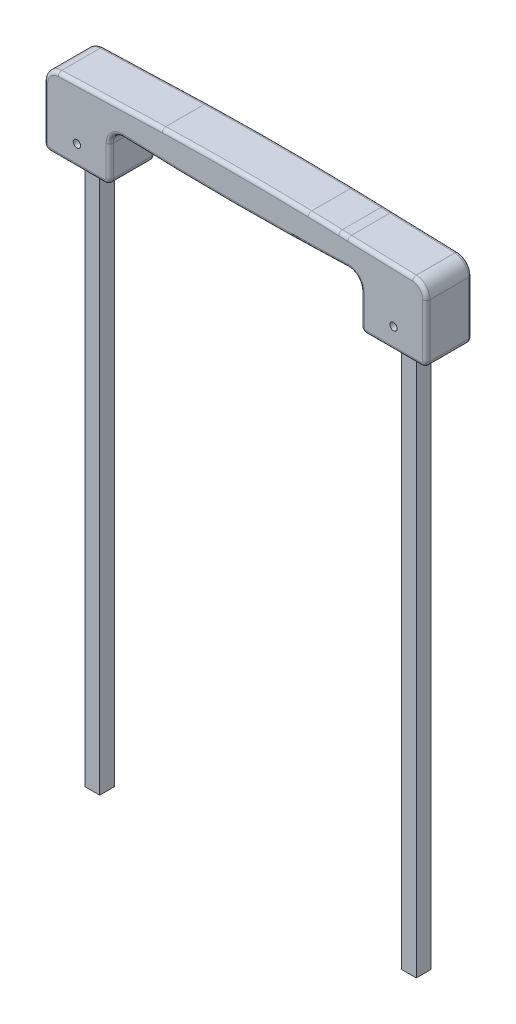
ISO-10303-21;
HEADER;
FILE_DESCRIPTION(('STEP AP214'),'2;1');
FILE_NAME('part.step','',(''),(''),'','','');
FILE_SCHEMA(('AUTOMOTIVE_DESIGN { 1 0 10303 214 1 1 1 1 }'));
ENDSEC;
DATA;
#1=APPLICATION_CONTEXT('core data for automotive mechanical design processes');
#2=APPLICATION_PROTOCOL_DEFINITION('international standard','automotive_design',2000,#1);
#3=PRODUCT_CONTEXT('',#1,'mechanical');
#4=PRODUCT('Part','Part','',(#3));
#5=PRODUCT_RELATED_PRODUCT_CATEGORY('part','',(#4));
#6=PRODUCT_DEFINITION_FORMATION('','',#4);
#7=PRODUCT_DEFINITION_CONTEXT('part definition',#1,'design');
#8=PRODUCT_DEFINITION('design','',#6,#7);
#9=PRODUCT_DEFINITION_SHAPE('','',#8);
#10=(LENGTH_UNIT() NAMED_UNIT(*) SI_UNIT(.MILLI.,.METRE.));
#11=(NAMED_UNIT(*) PLANE_ANGLE_UNIT() SI_UNIT($,.RADIAN.));
#12=(NAMED_UNIT(*) SI_UNIT($,.STERADIAN.) SOLID_ANGLE_UNIT());
#13=UNCERTAINTY_MEASURE_WITH_UNIT(LENGTH_MEASURE(1.E-05),#10,'distance_accuracy_value','');
#14=(GEOMETRIC_REPRESENTATION_CONTEXT(3) GLOBAL_UNCERTAINTY_ASSIGNED_CONTEXT((#13)) GLOBAL_UNIT_ASSIGNED_CONTEXT((#10,
#11,#12)) REPRESENTATION_CONTEXT('',''));
#15=CARTESIAN_POINT('',(0.,0.,0.));
#16=DIRECTION('',(0.,0.,1.));
#17=DIRECTION('',(1.,0.,0.));
#18=AXIS2_PLACEMENT_3D('',#15,#16,#17);
#19=CARTESIAN_POINT('',(86.755,0.,25.));
#20=DIRECTION('',(0.,0.,-1.));
#21=DIRECTION('',(-1.,0.,0.));
#22=AXIS2_PLACEMENT_3D('',#19,#20,#21);
#23=CYLINDRICAL_SURFACE('',#22,2.);
#24=CARTESIAN_POINT('',(86.755,0.,8.5));
#25=DIRECTION('',(0.,0.,-1.));
#26=DIRECTION('',(-1.,0.,0.));
#27=AXIS2_PLACEMENT_3D('',#24,#25,#26);
#28=CIRCLE('',#27,2.);
#29=CARTESIAN_POINT('',(84.755,0.,8.5));
#30=VERTEX_POINT('',#29);
#31=EDGE_CURVE('E43',#30,#30,#28,.T.);
#32=ORIENTED_EDGE('',*,*,#31,.F.);
#33=EDGE_LOOP('',(#32));
#34=FACE_BOUND('',#33,.T.);
#35=CARTESIAN_POINT('',(86.755,0.,0.));
#36=DIRECTION('',(0.,0.,1.));
#37=DIRECTION('',(1.,0.,0.));
#38=AXIS2_PLACEMENT_3D('',#35,#36,#37);
#39=CIRCLE('',#38,2.);
#40=CARTESIAN_POINT('',(88.755,0.,0.));
#41=VERTEX_POINT('',#40);
#42=EDGE_CURVE('E435',#41,#41,#39,.T.);
#43=ORIENTED_EDGE('',*,*,#42,.F.);
#44=EDGE_LOOP('',(#43));
#45=FACE_BOUND('',#44,.T.);
#46=ADVANCED_FACE('F38',(#34,#45),#23,.F.);
#47=CARTESIAN_POINT('',(-86.755,0.,25.));
#48=DIRECTION('',(0.,0.,-1.));
#49=DIRECTION('',(-1.,0.,0.));
#50=AXIS2_PLACEMENT_3D('',#47,#48,#49);
#51=CYLINDRICAL_SURFACE('',#50,2.);
#52=CARTESIAN_POINT('',(-86.755,0.,8.50000000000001));
#53=DIRECTION('',(0.,0.,-1.));
#54=DIRECTION('',(-1.,0.,0.));
#55=AXIS2_PLACEMENT_3D('',#52,#53,#54);
#56=CIRCLE('',#55,2.);
#57=CARTESIAN_POINT('',(-88.755,0.,8.50000000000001));
#58=VERTEX_POINT('',#57);
#59=EDGE_CURVE('E866',#58,#58,#56,.T.);
#60=ORIENTED_EDGE('',*,*,#59,.F.);
#61=EDGE_LOOP('',(#60));
#62=FACE_BOUND('',#61,.T.);
#63=CARTESIAN_POINT('',(-86.755,0.,0.));
#64=DIRECTION('',(0.,0.,1.));
#65=DIRECTION('',(1.,0.,0.));
#66=AXIS2_PLACEMENT_3D('',#63,#64,#65);
#67=CIRCLE('',#66,2.);
#68=CARTESIAN_POINT('',(-84.755,0.,0.));
#69=VERTEX_POINT('',#68);
#70=EDGE_CURVE('E439',#69,#69,#67,.T.);
#71=ORIENTED_EDGE('',*,*,#70,.F.);
#72=EDGE_LOOP('',(#71));
#73=FACE_BOUND('',#72,.T.);
#74=ADVANCED_FACE('F878',(#62,#73),#51,.F.);
#75=CARTESIAN_POINT('',(68.755,0.,25.));
#76=DIRECTION('',(-1.,0.,0.));
#77=DIRECTION('',(0.,0.,1.));
#78=AXIS2_PLACEMENT_3D('',#75,#76,#77);
#79=PLANE('',#78);
#80=DIRECTION('',(0.,0.,-1.));
#81=VECTOR('',#80,1.);
#82=CARTESIAN_POINT('',(68.755,-8.41312295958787,25.));
#83=LINE('',#82,#81);
#84=CARTESIAN_POINT('',(68.755,-8.41312295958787,23.));
#85=VERTEX_POINT('',#84);
#86=CARTESIAN_POINT('',(68.755,-8.41312295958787,2.));
#87=VERTEX_POINT('',#86);
#88=EDGE_CURVE('E494',#85,#87,#83,.T.);
#89=ORIENTED_EDGE('',*,*,#88,.F.);
#90=DIRECTION('',(0.,1.,0.));
#91=VECTOR('',#90,1.);
#92=CARTESIAN_POINT('',(68.755,0.,23.));
#93=LINE('',#92,#91);
#94=CARTESIAN_POINT('',(68.755,8.20407900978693,23.));
#95=VERTEX_POINT('',#94);
#96=EDGE_CURVE('E924',#85,#95,#93,.T.);
#97=ORIENTED_EDGE('',*,*,#96,.T.);
#98=DIRECTION('',(0.,0.,-1.));
#99=VECTOR('',#98,1.);
#100=CARTESIAN_POINT('',(68.755,8.20407900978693,25.));
#101=LINE('',#100,#99);
#102=CARTESIAN_POINT('',(68.755,8.20407900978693,2.));
#103=VERTEX_POINT('',#102);
#104=EDGE_CURVE('E438',#95,#103,#101,.T.);
#105=ORIENTED_EDGE('',*,*,#104,.T.);
#106=DIRECTION('',(0.,1.,0.));
#107=VECTOR('',#106,1.);
#108=CARTESIAN_POINT('',(68.755,-8.41312295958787,2.));
#109=LINE('',#108,#107);
#110=EDGE_CURVE('E920',#103,#87,#109,.F.);
#111=ORIENTED_EDGE('',*,*,#110,.T.);
#112=EDGE_LOOP('',(#89,#97,#105,#111));
#113=FACE_BOUND('',#112,.T.);
#114=ADVANCED_FACE('F1005',(#113),#79,.T.);
#115=CARTESIAN_POINT('',(71.755,-8.41312295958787,25.));
#116=DIRECTION('',(0.,0.,-1.));
#117=DIRECTION('',(-1.,0.,0.));
#118=AXIS2_PLACEMENT_3D('',#115,#116,#117);
#119=CYLINDRICAL_SURFACE('',#118,3.00000000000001);
#120=DIRECTION('',(0.,0.,-1.));
#121=VECTOR('',#120,1.);
#122=CARTESIAN_POINT('',(71.755,-11.4131229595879,25.));
#123=LINE('',#122,#121);
#124=CARTESIAN_POINT('',(71.755,-11.4131229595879,23.));
#125=VERTEX_POINT('',#124);
#126=CARTESIAN_POINT('',(71.755,-11.4131229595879,2.));
#127=VERTEX_POINT('',#126);
#128=EDGE_CURVE('E491',#125,#127,#123,.T.);
#129=ORIENTED_EDGE('',*,*,#128,.F.);
#130=CARTESIAN_POINT('',(71.755,-8.41312295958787,23.));
#131=DIRECTION('',(0.,0.,1.));
#132=DIRECTION('',(1.,0.,0.));
#133=AXIS2_PLACEMENT_3D('',#130,#131,#132);
#134=CIRCLE('',#133,3.00000000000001);
#135=EDGE_CURVE('E953',#125,#85,#134,.F.);
#136=ORIENTED_EDGE('',*,*,#135,.T.);
#137=ORIENTED_EDGE('',*,*,#88,.T.);
#138=CARTESIAN_POINT('',(71.755,-8.41312295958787,2.));
#139=DIRECTION('',(0.,0.,1.));
#140=DIRECTION('',(1.,0.,0.));
#141=AXIS2_PLACEMENT_3D('',#138,#139,#140);
#142=CIRCLE('',#141,3.00000000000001);
#143=EDGE_CURVE('E951',#87,#127,#142,.T.);
#144=ORIENTED_EDGE('',*,*,#143,.T.);
#145=EDGE_LOOP('',(#129,#136,#137,#144));
#146=FACE_BOUND('',#145,.T.);
#147=ADVANCED_FACE('F1008',(#146),#119,.T.);
#148=CARTESIAN_POINT('',(0.,-11.4131229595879,25.));
#149=DIRECTION('',(0.,-1.,0.));
#150=DIRECTION('',(1.,0.,0.));
#151=AXIS2_PLACEMENT_3D('',#148,#149,#150);
#152=PLANE('',#151);
#153=DIRECTION('',(0.,0.,1.));
#154=VECTOR('',#153,1.);
#155=CARTESIAN_POINT('',(90.755,-11.4131229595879,16.5));
#156=LINE('',#155,#154);
#157=CARTESIAN_POINT('',(90.755,-11.4131229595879,8.5));
#158=VERTEX_POINT('',#157);
#159=CARTESIAN_POINT('',(90.755,-11.4131229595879,16.5));
#160=VERTEX_POINT('',#159);
#161=EDGE_CURVE('E414',#158,#160,#156,.T.);
#162=ORIENTED_EDGE('',*,*,#161,.F.);
#163=DIRECTION('',(1.,0.,0.));
#164=VECTOR('',#163,1.);
#165=CARTESIAN_POINT('',(82.755,-11.4131229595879,8.5));
#166=LINE('',#165,#164);
#167=CARTESIAN_POINT('',(82.755,-11.4131229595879,8.5));
#168=VERTEX_POINT('',#167);
#169=EDGE_CURVE('E420',#168,#158,#166,.T.);
#170=ORIENTED_EDGE('',*,*,#169,.F.);
#171=DIRECTION('',(0.,0.,-1.));
#172=VECTOR('',#171,1.);
#173=CARTESIAN_POINT('',(82.755,-11.4131229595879,16.5));
#174=LINE('',#173,#172);
#175=CARTESIAN_POINT('',(82.755,-11.4131229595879,16.5));
#176=VERTEX_POINT('',#175);
#177=EDGE_CURVE('E417',#176,#168,#174,.T.);
#178=ORIENTED_EDGE('',*,*,#177,.F.);
#179=DIRECTION('',(-1.,0.,0.));
#180=VECTOR('',#179,1.);
#181=CARTESIAN_POINT('',(82.755,-11.4131229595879,16.5));
#182=LINE('',#181,#180);
#183=EDGE_CURVE('E56',#160,#176,#182,.T.);
#184=ORIENTED_EDGE('',*,*,#183,.F.);
#185=EDGE_LOOP('',(#162,#170,#178,#184));
#186=FACE_BOUND('',#185,.T.);
#187=DIRECTION('',(0.,0.,-1.));
#188=VECTOR('',#187,1.);
#189=CARTESIAN_POINT('',(101.755,-11.4131229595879,25.));
#190=LINE('',#189,#188);
#191=CARTESIAN_POINT('',(101.755,-11.4131229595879,23.));
#192=VERTEX_POINT('',#191);
#193=CARTESIAN_POINT('',(101.755,-11.4131229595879,2.));
#194=VERTEX_POINT('',#193);
#195=EDGE_CURVE('E488',#192,#194,#190,.T.);
#196=ORIENTED_EDGE('',*,*,#195,.F.);
#197=DIRECTION('',(-1.,0.,0.));
#198=VECTOR('',#197,1.);
#199=CARTESIAN_POINT('',(0.,-11.4131229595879,23.));
#200=LINE('',#199,#198);
#201=EDGE_CURVE('E957',#192,#125,#200,.T.);
#202=ORIENTED_EDGE('',*,*,#201,.T.);
#203=ORIENTED_EDGE('',*,*,#128,.T.);
#204=DIRECTION('',(-1.,0.,0.));
#205=VECTOR('',#204,1.);
#206=CARTESIAN_POINT('',(101.755,-11.4131229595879,2.));
#207=LINE('',#206,#205);
#208=EDGE_CURVE('E955',#127,#194,#207,.F.);
#209=ORIENTED_EDGE('',*,*,#208,.T.);
#210=EDGE_LOOP('',(#196,#202,#203,#209));
#211=FACE_BOUND('',#210,.T.);
#212=ADVANCED_FACE('F1265',(#186,#211),#152,.T.);
#213=CARTESIAN_POINT('',(101.755,-8.41312295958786,25.));
#214=DIRECTION('',(0.,0.,-1.));
#215=DIRECTION('',(-1.,0.,0.));
#216=AXIS2_PLACEMENT_3D('',#213,#214,#215);
#217=CYLINDRICAL_SURFACE('',#216,3.00000000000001);
#218=DIRECTION('',(0.,0.,-1.));
#219=VECTOR('',#218,1.);
#220=CARTESIAN_POINT('',(104.755,-8.41312295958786,25.));
#221=LINE('',#220,#219);
#222=CARTESIAN_POINT('',(104.755,-8.41312295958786,23.));
#223=VERTEX_POINT('',#222);
#224=CARTESIAN_POINT('',(104.755,-8.41312295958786,2.));
#225=VERTEX_POINT('',#224);
#226=EDGE_CURVE('E485',#223,#225,#221,.T.);
#227=ORIENTED_EDGE('',*,*,#226,.F.);
#228=CARTESIAN_POINT('',(101.755,-8.41312295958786,23.));
#229=DIRECTION('',(0.,0.,1.));
#230=DIRECTION('',(1.,0.,0.));
#231=AXIS2_PLACEMENT_3D('',#228,#229,#230);
#232=CIRCLE('',#231,3.00000000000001);
#233=EDGE_CURVE('E961',#223,#192,#232,.F.);
#234=ORIENTED_EDGE('',*,*,#233,.T.);
#235=ORIENTED_EDGE('',*,*,#195,.T.);
#236=CARTESIAN_POINT('',(101.755,-8.41312295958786,2.));
#237=DIRECTION('',(0.,0.,1.));
#238=DIRECTION('',(1.,0.,0.));
#239=AXIS2_PLACEMENT_3D('',#236,#237,#238);
#240=CIRCLE('',#239,3.00000000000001);
#241=EDGE_CURVE('E959',#194,#225,#240,.T.);
#242=ORIENTED_EDGE('',*,*,#241,.T.);
#243=EDGE_LOOP('',(#227,#234,#235,#242));
#244=FACE_BOUND('',#243,.T.);
#245=ADVANCED_FACE('F1261',(#244),#217,.T.);
#246=CARTESIAN_POINT('',(104.755,0.,25.));
#247=DIRECTION('',(-1.,0.,0.));
#248=DIRECTION('',(0.,0.,1.));
#249=AXIS2_PLACEMENT_3D('',#246,#247,#248);
#250=PLANE('',#249);
#251=DIRECTION('',(0.,0.,-1.));
#252=VECTOR('',#251,1.);
#253=CARTESIAN_POINT('',(104.755,20.7548359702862,25.));
#254=LINE('',#253,#252);
#255=CARTESIAN_POINT('',(104.755,20.7548359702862,23.));
#256=VERTEX_POINT('',#255);
#257=CARTESIAN_POINT('',(104.755,20.7548359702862,2.));
#258=VERTEX_POINT('',#257);
#259=EDGE_CURVE('E482',#256,#258,#254,.T.);
#260=ORIENTED_EDGE('',*,*,#259,.F.);
#261=DIRECTION('',(0.,1.,0.));
#262=VECTOR('',#261,1.);
#263=CARTESIAN_POINT('',(104.755,-8.41312295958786,23.));
#264=LINE('',#263,#262);
#265=EDGE_CURVE('E965',#256,#223,#264,.F.);
#266=ORIENTED_EDGE('',*,*,#265,.T.);
#267=ORIENTED_EDGE('',*,*,#226,.T.);
#268=DIRECTION('',(0.,1.,0.));
#269=VECTOR('',#268,1.);
#270=CARTESIAN_POINT('',(104.755,0.,2.));
#271=LINE('',#270,#269);
#272=EDGE_CURVE('E963',#225,#258,#271,.T.);
#273=ORIENTED_EDGE('',*,*,#272,.T.);
#274=EDGE_LOOP('',(#260,#266,#267,#273));
#275=FACE_BOUND('',#274,.T.);
#276=ADVANCED_FACE('F1255',(#275),#250,.F.);
#277=CARTESIAN_POINT('',(96.755,20.7548359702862,25.));
#278=DIRECTION('',(0.,0.,-1.));
#279=DIRECTION('',(-1.,0.,0.));
#280=AXIS2_PLACEMENT_3D('',#277,#278,#279);
#281=CYLINDRICAL_SURFACE('',#280,8.00000000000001);
#282=DIRECTION('',(0.,0.,-1.));
#283=VECTOR('',#282,1.);
#284=CARTESIAN_POINT('',(97.371243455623,28.7310659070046,25.));
#285=LINE('',#284,#283);
#286=CARTESIAN_POINT('',(97.3712434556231,28.7310659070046,2.));
#287=VERTEX_POINT('',#286);
#288=CARTESIAN_POINT('',(97.371243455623,28.7310659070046,23.));
#289=VERTEX_POINT('',#288);
#290=EDGE_CURVE('E969',#287,#289,#285,.F.);
#291=ORIENTED_EDGE('',*,*,#290,.T.);
#292=CARTESIAN_POINT('',(96.755,20.7548359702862,23.));
#293=DIRECTION('',(0.,0.,1.));
#294=DIRECTION('',(1.,0.,0.));
#295=AXIS2_PLACEMENT_3D('',#292,#293,#294);
#296=CIRCLE('',#295,8.00000000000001);
#297=EDGE_CURVE('E971',#289,#256,#296,.F.);
#298=ORIENTED_EDGE('',*,*,#297,.T.);
#299=ORIENTED_EDGE('',*,*,#259,.T.);
#300=CARTESIAN_POINT('',(96.755,20.7548359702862,2.));
#301=DIRECTION('',(0.,0.,1.));
#302=DIRECTION('',(1.,0.,0.));
#303=AXIS2_PLACEMENT_3D('',#300,#301,#302);
#304=CIRCLE('',#303,8.00000000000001);
#305=EDGE_CURVE('E967',#258,#287,#304,.T.);
#306=ORIENTED_EDGE('',*,*,#305,.T.);
#307=EDGE_LOOP('',(#291,#298,#299,#306));
#308=FACE_BOUND('',#307,.T.);
#309=ADVANCED_FACE('F1250',(#308),#281,.T.);
#310=CARTESIAN_POINT('',(0.981169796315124,31.7152079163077,25.));
#311=DIRECTION('',(0.0309220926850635,0.999521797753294,0.));
#312=DIRECTION('',(-0.999521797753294,0.0309220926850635,0.));
#313=AXIS2_PLACEMENT_3D('',#310,#311,#312);
#314=PLANE('',#313);
#315=DIRECTION('',(0.999521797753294,-0.0309220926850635,0.));
#316=VECTOR('',#315,1.);
#317=CARTESIAN_POINT('',(0.981169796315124,31.7152079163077,23.));
#318=LINE('',#317,#316);
#319=CARTESIAN_POINT('',(61.755,29.8350548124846,23.));
#320=VERTEX_POINT('',#319);
#321=CARTESIAN_POINT('',(97.2790267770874,28.7360520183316,23.));
#322=VERTEX_POINT('',#321);
#323=EDGE_CURVE('E557',#320,#322,#318,.T.);
#324=ORIENTED_EDGE('',*,*,#323,.T.);
#325=DIRECTION('',(0.,0.,1.));
#326=VECTOR('',#325,1.);
#327=CARTESIAN_POINT('',(97.2790267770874,28.7360520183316,2.));
#328=LINE('',#327,#326);
#329=CARTESIAN_POINT('',(97.2790267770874,28.7360520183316,2.));
#330=VERTEX_POINT('',#329);
#331=EDGE_CURVE('E975',#322,#330,#328,.F.);
#332=ORIENTED_EDGE('',*,*,#331,.T.);
#333=DIRECTION('',(0.999521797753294,-0.0309220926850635,0.));
#334=VECTOR('',#333,1.);
#335=CARTESIAN_POINT('',(61.755,29.8350548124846,2.));
#336=LINE('',#335,#334);
#337=CARTESIAN_POINT('',(61.755,29.8350548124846,2.));
#338=VERTEX_POINT('',#337);
#339=EDGE_CURVE('E560',#330,#338,#336,.F.);
#340=ORIENTED_EDGE('',*,*,#339,.T.);
#341=DIRECTION('',(0.,0.,-1.));
#342=VECTOR('',#341,1.);
#343=CARTESIAN_POINT('',(61.755,29.8350548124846,25.));
#344=LINE('',#343,#342);
#345=EDGE_CURVE('E479',#320,#338,#344,.T.);
#346=ORIENTED_EDGE('',*,*,#345,.F.);
#347=EDGE_LOOP('',(#324,#332,#340,#346));
#348=FACE_BOUND('',#347,.T.);
#349=ADVANCED_FACE('F1047',(#348),#314,.T.);
#350=CARTESIAN_POINT('',(-0.00109852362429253,-1492.86361248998,25.));
#351=DIRECTION('',(0.,0.,-1.));
#352=DIRECTION('',(-1.,0.,0.));
#353=AXIS2_PLACEMENT_3D('',#350,#351,#352);
#354=CYLINDRICAL_SURFACE('',#353,1523.95047396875);
#355=ORIENTED_EDGE('',*,*,#345,.T.);
#356=CARTESIAN_POINT('',(-0.00109852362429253,-1492.86361248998,2.));
#357=DIRECTION('',(0.,0.,1.));
#358=DIRECTION('',(1.,0.,0.));
#359=AXIS2_PLACEMENT_3D('',#356,#357,#358);
#360=CIRCLE('',#359,1523.95047396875);
#361=CARTESIAN_POINT('',(56.769289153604,30.0290856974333,2.));
#362=VERTEX_POINT('',#361);
#363=EDGE_CURVE('E564',#338,#362,#360,.T.);
#364=ORIENTED_EDGE('',*,*,#363,.T.);
#365=DIRECTION('',(0.,0.,-1.));
#366=VECTOR('',#365,1.);
#367=CARTESIAN_POINT('',(56.769289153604,30.0290856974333,25.));
#368=LINE('',#367,#366);
#369=CARTESIAN_POINT('',(56.769289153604,30.0290856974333,23.));
#370=VERTEX_POINT('',#369);
#371=EDGE_CURVE('E476',#370,#362,#368,.T.);
#372=ORIENTED_EDGE('',*,*,#371,.F.);
#373=CARTESIAN_POINT('',(-0.00109852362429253,-1492.86361248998,23.));
#374=DIRECTION('',(0.,0.,1.));
#375=DIRECTION('',(1.,0.,0.));
#376=AXIS2_PLACEMENT_3D('',#373,#374,#375);
#377=CIRCLE('',#376,1523.95047396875);
#378=EDGE_CURVE('E562',#370,#320,#377,.F.);
#379=ORIENTED_EDGE('',*,*,#378,.T.);
#380=EDGE_LOOP('',(#355,#364,#372,#379));
#381=FACE_BOUND('',#380,.T.);
#382=ADVANCED_FACE('F1162',(#381),#354,.T.);
#383=CARTESIAN_POINT('',(1.01019289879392,31.8003684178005,25.));
#384=DIRECTION('',(0.0317506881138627,0.999495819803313,0.));
#385=DIRECTION('',(-0.999495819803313,0.0317506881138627,0.));
#386=AXIS2_PLACEMENT_3D('',#383,#384,#385);
#387=PLANE('',#386);
#388=ORIENTED_EDGE('',*,*,#371,.T.);
#389=DIRECTION('',(0.999495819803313,-0.0317506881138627,0.));
#390=VECTOR('',#389,1.);
#391=CARTESIAN_POINT('',(39.9999999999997,30.5617907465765,2.));
#392=LINE('',#391,#390);
#393=CARTESIAN_POINT('',(40.0055037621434,30.5616159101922,2.));
#394=VERTEX_POINT('',#393);
#395=EDGE_CURVE('E570',#362,#394,#392,.F.);
#396=ORIENTED_EDGE('',*,*,#395,.T.);
#397=DIRECTION('',(0.,0.,-1.));
#398=VECTOR('',#397,1.);
#399=CARTESIAN_POINT('',(40.0055037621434,30.5616159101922,25.));
#400=LINE('',#399,#398);
#401=CARTESIAN_POINT('',(40.0055037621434,30.5616159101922,23.));
#402=VERTEX_POINT('',#401);
#403=EDGE_CURVE('E566',#394,#402,#400,.F.);
#404=ORIENTED_EDGE('',*,*,#403,.T.);
#405=DIRECTION('',(0.999495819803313,-0.0317506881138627,0.));
#406=VECTOR('',#405,1.);
#407=CARTESIAN_POINT('',(1.01019289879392,31.8003684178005,23.));
#408=LINE('',#407,#406);
#409=EDGE_CURVE('E568',#402,#370,#408,.T.);
#410=ORIENTED_EDGE('',*,*,#409,.T.);
#411=EDGE_LOOP('',(#388,#396,#404,#410));
#412=FACE_BOUND('',#411,.T.);
#413=ADVANCED_FACE('F1158',(#412),#387,.T.);
#414=CARTESIAN_POINT('',(-0.00109852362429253,-1492.86361248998,23.));
#415=DIRECTION('',(0.,0.,1.));
#416=DIRECTION('',(1.,0.,0.));
#417=AXIS2_PLACEMENT_3D('',#414,#415,#416);
#418=CIRCLE('',#417,1523.95047396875);
#419=CARTESIAN_POINT('',(-39.9944894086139,30.5619931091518,23.));
#420=VERTEX_POINT('',#419);
#421=CARTESIAN_POINT('',(39.9944917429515,30.561935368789,23.));
#422=VERTEX_POINT('',#421);
#423=EDGE_CURVE('E600',#420,#422,#418,.F.);
#424=ORIENTED_EDGE('',*,*,#423,.T.);
#425=DIRECTION('',(0.,0.,-1.));
#426=VECTOR('',#425,1.);
#427=CARTESIAN_POINT('',(39.9944917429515,30.5619353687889,25.));
#428=LINE('',#427,#426);
#429=CARTESIAN_POINT('',(39.9944917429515,30.561935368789,2.));
#430=VERTEX_POINT('',#429);
#431=EDGE_CURVE('E602',#422,#430,#428,.T.);
#432=ORIENTED_EDGE('',*,*,#431,.T.);
#433=CARTESIAN_POINT('',(-0.00109852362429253,-1492.86361248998,2.));
#434=DIRECTION('',(0.,0.,1.));
#435=DIRECTION('',(1.,0.,0.));
#436=AXIS2_PLACEMENT_3D('',#433,#434,#435);
#437=CIRCLE('',#436,1523.95047396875);
#438=CARTESIAN_POINT('',(-39.9944894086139,30.5619931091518,2.));
#439=VERTEX_POINT('',#438);
#440=EDGE_CURVE('E596',#430,#439,#437,.T.);
#441=ORIENTED_EDGE('',*,*,#440,.T.);
#442=DIRECTION('',(0.,0.,-1.));
#443=VECTOR('',#442,1.);
#444=CARTESIAN_POINT('',(-39.9944894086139,30.5619931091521,25.));
#445=LINE('',#444,#443);
#446=EDGE_CURVE('E598',#439,#420,#445,.F.);
#447=ORIENTED_EDGE('',*,*,#446,.T.);
#448=EDGE_LOOP('',(#424,#432,#441,#447));
#449=FACE_BOUND('',#448,.T.);
#450=ADVANCED_FACE('F1236',(#449),#354,.T.);
#451=CARTESIAN_POINT('',(-1.01022414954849,31.8004598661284,25.));
#452=DIRECTION('',(-0.0317515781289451,0.99949579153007,0.));
#453=DIRECTION('',(-0.99949579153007,-0.0317515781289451,0.));
#454=AXIS2_PLACEMENT_3D('',#451,#452,#453);
#455=PLANE('',#454);
#456=DIRECTION('',(0.,0.,-1.));
#457=VECTOR('',#456,1.);
#458=CARTESIAN_POINT('',(-40.0055060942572,30.5616735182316,25.));
#459=LINE('',#458,#457);
#460=CARTESIAN_POINT('',(-40.0055060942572,30.5616735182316,23.));
#461=VERTEX_POINT('',#460);
#462=CARTESIAN_POINT('',(-40.0055060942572,30.5616735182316,2.));
#463=VERTEX_POINT('',#462);
#464=EDGE_CURVE('E553',#461,#463,#459,.T.);
#465=ORIENTED_EDGE('',*,*,#464,.T.);
#466=DIRECTION('',(0.99949579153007,0.0317515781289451,0.));
#467=VECTOR('',#466,1.);
#468=CARTESIAN_POINT('',(-97.0090126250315,28.7508091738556,2.));
#469=LINE('',#468,#467);
#470=CARTESIAN_POINT('',(-97.0090126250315,28.7508091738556,2.));
#471=VERTEX_POINT('',#470);
#472=EDGE_CURVE('E555',#463,#471,#469,.F.);
#473=ORIENTED_EDGE('',*,*,#472,.T.);
#474=DIRECTION('',(0.,0.,-1.));
#475=VECTOR('',#474,1.);
#476=CARTESIAN_POINT('',(-97.0090126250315,28.7508091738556,25.));
#477=LINE('',#476,#475);
#478=CARTESIAN_POINT('',(-97.0090126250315,28.7508091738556,23.));
#479=VERTEX_POINT('',#478);
#480=EDGE_CURVE('E473',#479,#471,#477,.T.);
#481=ORIENTED_EDGE('',*,*,#480,.F.);
#482=DIRECTION('',(0.99949579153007,0.0317515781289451,0.));
#483=VECTOR('',#482,1.);
#484=CARTESIAN_POINT('',(-1.01022414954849,31.8004598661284,23.));
#485=LINE('',#484,#483);
#486=EDGE_CURVE('E551',#479,#461,#485,.T.);
#487=ORIENTED_EDGE('',*,*,#486,.T.);
#488=EDGE_LOOP('',(#465,#473,#481,#487));
#489=FACE_BOUND('',#488,.T.);
#490=ADVANCED_FACE('F1175',(#489),#455,.T.);
#491=CARTESIAN_POINT('',(-96.755,20.754842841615,25.));
#492=DIRECTION('',(0.,0.,-1.));
#493=DIRECTION('',(-1.,0.,0.));
#494=AXIS2_PLACEMENT_3D('',#491,#492,#493);
#495=CYLINDRICAL_SURFACE('',#494,8.);
#496=ORIENTED_EDGE('',*,*,#480,.T.);
#497=CARTESIAN_POINT('',(-96.755,20.754842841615,2.));
#498=DIRECTION('',(0.,0.,1.));
#499=DIRECTION('',(1.,0.,0.));
#500=AXIS2_PLACEMENT_3D('',#497,#498,#499);
#501=CIRCLE('',#500,8.);
#502=CARTESIAN_POINT('',(-104.755,20.754842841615,2.));
#503=VERTEX_POINT('',#502);
#504=EDGE_CURVE('E549',#471,#503,#501,.T.);
#505=ORIENTED_EDGE('',*,*,#504,.T.);
#506=DIRECTION('',(0.,0.,-1.));
#507=VECTOR('',#506,1.);
#508=CARTESIAN_POINT('',(-104.755,20.754842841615,25.));
#509=LINE('',#508,#507);
#510=CARTESIAN_POINT('',(-104.755,20.754842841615,23.));
#511=VERTEX_POINT('',#510);
#512=EDGE_CURVE('E470',#511,#503,#509,.T.);
#513=ORIENTED_EDGE('',*,*,#512,.F.);
#514=CARTESIAN_POINT('',(-96.755,20.754842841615,23.));
#515=DIRECTION('',(0.,0.,1.));
#516=DIRECTION('',(1.,0.,0.));
#517=AXIS2_PLACEMENT_3D('',#514,#515,#516);
#518=CIRCLE('',#517,8.);
#519=EDGE_CURVE('E547',#511,#479,#518,.F.);
#520=ORIENTED_EDGE('',*,*,#519,.T.);
#521=EDGE_LOOP('',(#496,#505,#513,#520));
#522=FACE_BOUND('',#521,.T.);
#523=ADVANCED_FACE('F1243',(#522),#495,.T.);
#524=CARTESIAN_POINT('',(-104.755,0.,25.));
#525=DIRECTION('',(-1.,0.,0.));
#526=DIRECTION('',(0.,0.,1.));
#527=AXIS2_PLACEMENT_3D('',#524,#525,#526);
#528=PLANE('',#527);
#529=ORIENTED_EDGE('',*,*,#512,.T.);
#530=DIRECTION('',(0.,1.,0.));
#531=VECTOR('',#530,1.);
#532=CARTESIAN_POINT('',(-104.755,-8.41312295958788,2.));
#533=LINE('',#532,#531);
#534=CARTESIAN_POINT('',(-104.755,-8.41312295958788,2.));
#535=VERTEX_POINT('',#534);
#536=EDGE_CURVE('E545',#503,#535,#533,.F.);
#537=ORIENTED_EDGE('',*,*,#536,.T.);
#538=DIRECTION('',(0.,0.,-1.));
#539=VECTOR('',#538,1.);
#540=CARTESIAN_POINT('',(-104.755,-8.41312295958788,25.));
#541=LINE('',#540,#539);
#542=CARTESIAN_POINT('',(-104.755,-8.41312295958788,23.));
#543=VERTEX_POINT('',#542);
#544=EDGE_CURVE('E467',#543,#535,#541,.T.);
#545=ORIENTED_EDGE('',*,*,#544,.F.);
#546=DIRECTION('',(0.,1.,0.));
#547=VECTOR('',#546,1.);
#548=CARTESIAN_POINT('',(-104.755,0.,23.));
#549=LINE('',#548,#547);
#550=EDGE_CURVE('E543',#543,#511,#549,.T.);
#551=ORIENTED_EDGE('',*,*,#550,.T.);
#552=EDGE_LOOP('',(#529,#537,#545,#551));
#553=FACE_BOUND('',#552,.T.);
#554=ADVANCED_FACE('F1830',(#553),#528,.T.);
#555=CARTESIAN_POINT('',(-101.755,-8.41312295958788,25.));
#556=DIRECTION('',(0.,0.,-1.));
#557=DIRECTION('',(-1.,0.,0.));
#558=AXIS2_PLACEMENT_3D('',#555,#556,#557);
#559=CYLINDRICAL_SURFACE('',#558,3.);
#560=ORIENTED_EDGE('',*,*,#544,.T.);
#561=CARTESIAN_POINT('',(-101.755,-8.41312295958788,2.));
#562=DIRECTION('',(0.,0.,1.));
#563=DIRECTION('',(1.,0.,0.));
#564=AXIS2_PLACEMENT_3D('',#561,#562,#563);
#565=CIRCLE('',#564,3.);
#566=CARTESIAN_POINT('',(-101.755,-11.4131229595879,2.));
#567=VERTEX_POINT('',#566);
#568=EDGE_CURVE('E541',#535,#567,#565,.T.);
#569=ORIENTED_EDGE('',*,*,#568,.T.);
#570=DIRECTION('',(0.,0.,-1.));
#571=VECTOR('',#570,1.);
#572=CARTESIAN_POINT('',(-101.755,-11.4131229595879,25.));
#573=LINE('',#572,#571);
#574=CARTESIAN_POINT('',(-101.755,-11.4131229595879,23.));
#575=VERTEX_POINT('',#574);
#576=EDGE_CURVE('E464',#575,#567,#573,.T.);
#577=ORIENTED_EDGE('',*,*,#576,.F.);
#578=CARTESIAN_POINT('',(-101.755,-8.41312295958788,23.));
#579=DIRECTION('',(0.,0.,1.));
#580=DIRECTION('',(1.,0.,0.));
#581=AXIS2_PLACEMENT_3D('',#578,#579,#580);
#582=CIRCLE('',#581,3.);
#583=EDGE_CURVE('E539',#575,#543,#582,.F.);
#584=ORIENTED_EDGE('',*,*,#583,.T.);
#585=EDGE_LOOP('',(#560,#569,#577,#584));
#586=FACE_BOUND('',#585,.T.);
#587=ADVANCED_FACE('F1825',(#586),#559,.T.);
#588=CARTESIAN_POINT('',(0.,-11.4131229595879,25.));
#589=DIRECTION('',(0.,1.,0.));
#590=DIRECTION('',(0.,0.,1.));
#591=AXIS2_PLACEMENT_3D('',#588,#589,#590);
#592=PLANE('',#591);
#593=DIRECTION('',(-1.,0.,0.));
#594=VECTOR('',#593,1.);
#595=CARTESIAN_POINT('',(-90.755,-11.4131229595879,16.5));
#596=LINE('',#595,#594);
#597=CARTESIAN_POINT('',(-82.755,-11.4131229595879,16.5));
#598=VERTEX_POINT('',#597);
#599=CARTESIAN_POINT('',(-90.755,-11.4131229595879,16.5));
#600=VERTEX_POINT('',#599);
#601=EDGE_CURVE('E64',#598,#600,#596,.T.);
#602=ORIENTED_EDGE('',*,*,#601,.F.);
#603=DIRECTION('',(0.,0.,1.));
#604=VECTOR('',#603,1.);
#605=CARTESIAN_POINT('',(-82.755,-11.4131229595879,16.5));
#606=LINE('',#605,#604);
#607=CARTESIAN_POINT('',(-82.755,-11.4131229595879,8.50000000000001));
#608=VERTEX_POINT('',#607);
#609=EDGE_CURVE('E424',#608,#598,#606,.T.);
#610=ORIENTED_EDGE('',*,*,#609,.F.);
#611=DIRECTION('',(1.,0.,0.));
#612=VECTOR('',#611,1.);
#613=CARTESIAN_POINT('',(-90.755,-11.4131229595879,8.50000000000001));
#614=LINE('',#613,#612);
#615=CARTESIAN_POINT('',(-90.755,-11.4131229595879,8.50000000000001));
#616=VERTEX_POINT('',#615);
#617=EDGE_CURVE('E428',#616,#608,#614,.T.);
#618=ORIENTED_EDGE('',*,*,#617,.F.);
#619=DIRECTION('',(0.,0.,-1.));
#620=VECTOR('',#619,1.);
#621=CARTESIAN_POINT('',(-90.755,-11.4131229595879,16.5));
#622=LINE('',#621,#620);
#623=EDGE_CURVE('E387',#600,#616,#622,.T.);
#624=ORIENTED_EDGE('',*,*,#623,.F.);
#625=EDGE_LOOP('',(#602,#610,#618,#624));
#626=FACE_BOUND('',#625,.T.);
#627=ORIENTED_EDGE('',*,*,#576,.T.);
#628=DIRECTION('',(1.,0.,0.));
#629=VECTOR('',#628,1.);
#630=CARTESIAN_POINT('',(0.,-11.4131229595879,2.));
#631=LINE('',#630,#629);
#632=CARTESIAN_POINT('',(-71.755,-11.4131229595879,2.));
#633=VERTEX_POINT('',#632);
#634=EDGE_CURVE('E537',#567,#633,#631,.T.);
#635=ORIENTED_EDGE('',*,*,#634,.T.);
#636=DIRECTION('',(0.,0.,-1.));
#637=VECTOR('',#636,1.);
#638=CARTESIAN_POINT('',(-71.755,-11.4131229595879,25.));
#639=LINE('',#638,#637);
#640=CARTESIAN_POINT('',(-71.755,-11.4131229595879,23.));
#641=VERTEX_POINT('',#640);
#642=EDGE_CURVE('E461',#641,#633,#639,.T.);
#643=ORIENTED_EDGE('',*,*,#642,.F.);
#644=DIRECTION('',(1.,0.,0.));
#645=VECTOR('',#644,1.);
#646=CARTESIAN_POINT('',(-101.755,-11.4131229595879,23.));
#647=LINE('',#646,#645);
#648=EDGE_CURVE('E535',#641,#575,#647,.F.);
#649=ORIENTED_EDGE('',*,*,#648,.T.);
#650=EDGE_LOOP('',(#627,#635,#643,#649));
#651=FACE_BOUND('',#650,.T.);
#652=ADVANCED_FACE('F1217',(#626,#651),#592,.F.);
#653=CARTESIAN_POINT('',(-71.755,-8.41312295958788,25.));
#654=DIRECTION('',(0.,0.,-1.));
#655=DIRECTION('',(-1.,0.,0.));
#656=AXIS2_PLACEMENT_3D('',#653,#654,#655);
#657=CYLINDRICAL_SURFACE('',#656,3.);
#658=ORIENTED_EDGE('',*,*,#642,.T.);
#659=CARTESIAN_POINT('',(-71.755,-8.41312295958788,2.));
#660=DIRECTION('',(0.,0.,1.));
#661=DIRECTION('',(1.,0.,0.));
#662=AXIS2_PLACEMENT_3D('',#659,#660,#661);
#663=CIRCLE('',#662,3.);
#664=CARTESIAN_POINT('',(-68.755,-8.41312295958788,2.));
#665=VERTEX_POINT('',#664);
#666=EDGE_CURVE('E533',#633,#665,#663,.T.);
#667=ORIENTED_EDGE('',*,*,#666,.T.);
#668=DIRECTION('',(0.,0.,-1.));
#669=VECTOR('',#668,1.);
#670=CARTESIAN_POINT('',(-68.755,-8.41312295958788,25.));
#671=LINE('',#670,#669);
#672=CARTESIAN_POINT('',(-68.755,-8.41312295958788,23.));
#673=VERTEX_POINT('',#672);
#674=EDGE_CURVE('E458',#673,#665,#671,.T.);
#675=ORIENTED_EDGE('',*,*,#674,.F.);
#676=CARTESIAN_POINT('',(-71.755,-8.41312295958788,23.));
#677=DIRECTION('',(0.,0.,1.));
#678=DIRECTION('',(1.,0.,0.));
#679=AXIS2_PLACEMENT_3D('',#676,#677,#678);
#680=CIRCLE('',#679,3.);
#681=EDGE_CURVE('E531',#673,#641,#680,.F.);
#682=ORIENTED_EDGE('',*,*,#681,.T.);
#683=EDGE_LOOP('',(#658,#667,#675,#682));
#684=FACE_BOUND('',#683,.T.);
#685=ADVANCED_FACE('F1214',(#684),#657,.T.);
#686=CARTESIAN_POINT('',(-68.755,0.,25.));
#687=DIRECTION('',(-1.,0.,0.));
#688=DIRECTION('',(0.,0.,1.));
#689=AXIS2_PLACEMENT_3D('',#686,#687,#688);
#690=PLANE('',#689);
#691=ORIENTED_EDGE('',*,*,#674,.T.);
#692=DIRECTION('',(0.,1.,0.));
#693=VECTOR('',#692,1.);
#694=CARTESIAN_POINT('',(-68.755,0.,2.));
#695=LINE('',#694,#693);
#696=CARTESIAN_POINT('',(-68.755,8.20407900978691,2.));
#697=VERTEX_POINT('',#696);
#698=EDGE_CURVE('E529',#665,#697,#695,.T.);
#699=ORIENTED_EDGE('',*,*,#698,.T.);
#700=DIRECTION('',(0.,0.,-1.));
#701=VECTOR('',#700,1.);
#702=CARTESIAN_POINT('',(-68.755,8.20407900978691,25.));
#703=LINE('',#702,#701);
#704=CARTESIAN_POINT('',(-68.755,8.20407900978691,23.));
#705=VERTEX_POINT('',#704);
#706=EDGE_CURVE('E455',#705,#697,#703,.T.);
#707=ORIENTED_EDGE('',*,*,#706,.F.);
#708=DIRECTION('',(0.,1.,0.));
#709=VECTOR('',#708,1.);
#710=CARTESIAN_POINT('',(-68.755,-8.41312295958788,23.));
#711=LINE('',#710,#709);
#712=EDGE_CURVE('E527',#705,#673,#711,.F.);
#713=ORIENTED_EDGE('',*,*,#712,.T.);
#714=EDGE_LOOP('',(#691,#699,#707,#713));
#715=FACE_BOUND('',#714,.T.);
#716=ADVANCED_FACE('F1211',(#715),#690,.F.);
#717=CARTESIAN_POINT('',(-61.755,8.20407900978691,25.));
#718=DIRECTION('',(0.,0.,-1.));
#719=DIRECTION('',(-1.,0.,0.));
#720=AXIS2_PLACEMENT_3D('',#717,#718,#719);
#721=CYLINDRICAL_SURFACE('',#720,7.);
#722=ORIENTED_EDGE('',*,*,#706,.T.);
#723=CARTESIAN_POINT('',(-61.755,8.20407900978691,2.));
#724=DIRECTION('',(0.,0.,1.));
#725=DIRECTION('',(1.,0.,0.));
#726=AXIS2_PLACEMENT_3D('',#723,#724,#725);
#727=CIRCLE('',#726,7.);
#728=CARTESIAN_POINT('',(-61.755,15.2040790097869,2.));
#729=VERTEX_POINT('',#728);
#730=EDGE_CURVE('E525',#697,#729,#727,.F.);
#731=ORIENTED_EDGE('',*,*,#730,.T.);
#732=DIRECTION('',(0.,0.,-1.));
#733=VECTOR('',#732,1.);
#734=CARTESIAN_POINT('',(-61.755,15.2040790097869,25.));
#735=LINE('',#734,#733);
#736=CARTESIAN_POINT('',(-61.755,15.2040790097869,23.));
#737=VERTEX_POINT('',#736);
#738=EDGE_CURVE('E452',#737,#729,#735,.T.);
#739=ORIENTED_EDGE('',*,*,#738,.F.);
#740=CARTESIAN_POINT('',(-61.755,8.20407900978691,23.));
#741=DIRECTION('',(0.,0.,1.));
#742=DIRECTION('',(1.,0.,0.));
#743=AXIS2_PLACEMENT_3D('',#740,#741,#742);
#744=CIRCLE('',#743,7.);
#745=EDGE_CURVE('E523',#737,#705,#744,.T.);
#746=ORIENTED_EDGE('',*,*,#745,.T.);
#747=EDGE_LOOP('',(#722,#731,#739,#746));
#748=FACE_BOUND('',#747,.T.);
#749=ADVANCED_FACE('F905',(#748),#721,.F.);
#750=CARTESIAN_POINT('',(-1.87350135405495E-13,1536.31154493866,25.));
#751=DIRECTION('',(0.,0.,-1.));
#752=DIRECTION('',(-1.,0.,0.));
#753=AXIS2_PLACEMENT_3D('',#750,#751,#752);
#754=CYLINDRICAL_SURFACE('',#753,1522.36053644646);
#755=DIRECTION('',(0.,0.,-1.));
#756=VECTOR('',#755,1.);
#757=CARTESIAN_POINT('',(61.755,15.2040790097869,25.));
#758=LINE('',#757,#756);
#759=CARTESIAN_POINT('',(61.755,15.2040790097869,23.));
#760=VERTEX_POINT('',#759);
#761=CARTESIAN_POINT('',(61.755,15.2040790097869,2.));
#762=VERTEX_POINT('',#761);
#763=EDGE_CURVE('E449',#760,#762,#758,.T.);
#764=ORIENTED_EDGE('',*,*,#763,.F.);
#765=CARTESIAN_POINT('',(-1.87350135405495E-13,1536.31154493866,23.));
#766=DIRECTION('',(0.,0.,1.));
#767=DIRECTION('',(1.,0.,0.));
#768=AXIS2_PLACEMENT_3D('',#765,#766,#767);
#769=CIRCLE('',#768,1522.36053644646);
#770=EDGE_CURVE('E992',#760,#737,#769,.F.);
#771=ORIENTED_EDGE('',*,*,#770,.T.);
#772=ORIENTED_EDGE('',*,*,#738,.T.);
#773=CARTESIAN_POINT('',(-61.755,15.2040790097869,2.));
#774=CARTESIAN_POINT('',(-61.754970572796,15.2040778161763,1.99393682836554));
#775=CARTESIAN_POINT('',(-61.7556781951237,15.2041065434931,1.98792918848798));
#776=CARTESIAN_POINT('',(-61.758246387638,15.2042108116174,1.97630573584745));
#777=CARTESIAN_POINT('',(-61.7600794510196,15.2042852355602,1.97068403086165));
#778=CARTESIAN_POINT('',(-61.7654860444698,15.2045047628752,1.95769468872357));
#779=CARTESIAN_POINT('',(-61.7694595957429,15.2046661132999,1.95050160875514));
#780=CARTESIAN_POINT('',(-61.7784440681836,15.2050309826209,1.93671319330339));
#781=CARTESIAN_POINT('',(-61.7834666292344,15.2052349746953,1.93012587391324));
#782=CARTESIAN_POINT('',(-61.8063268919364,15.2061635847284,1.90277912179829));
#783=CARTESIAN_POINT('',(-61.8269484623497,15.207001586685,1.88446121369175));
#784=CARTESIAN_POINT('',(-61.8697463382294,15.2087417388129,1.84991311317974));
#785=CARTESIAN_POINT('',(-61.891929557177,15.2096441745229,1.83369324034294));
#786=CARTESIAN_POINT('',(-61.9589211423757,15.2123709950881,1.78708470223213));
#787=CARTESIAN_POINT('',(-62.004811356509,15.2142408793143,1.75820710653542));
#788=CARTESIAN_POINT('',(-62.0974650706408,15.2180205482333,1.70188867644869));
#789=CARTESIAN_POINT('',(-62.1442296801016,15.2199303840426,1.6744498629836));
#790=CARTESIAN_POINT('',(-62.238127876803,15.2237695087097,1.62050822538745));
#791=CARTESIAN_POINT('',(-62.2852599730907,15.2256987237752,1.5940028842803));
#792=CARTESIAN_POINT('',(-62.3797986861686,15.2295728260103,1.54156436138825));
#793=CARTESIAN_POINT('',(-62.4272051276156,15.2315177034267,1.51563085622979));
#794=CARTESIAN_POINT('',(-62.570035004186,15.2373841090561,1.43834071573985));
#795=CARTESIAN_POINT('',(-62.6658136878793,15.2413269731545,1.38763869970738));
#796=CARTESIAN_POINT('',(-62.8581291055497,15.2492622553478,1.28769625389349));
#797=CARTESIAN_POINT('',(-62.9546658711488,15.2532546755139,1.23845588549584));
#798=CARTESIAN_POINT('',(-63.2454806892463,15.265309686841,1.09298028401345));
#799=CARTESIAN_POINT('',(-63.4409062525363,15.2734476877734,0.999021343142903));
#800=CARTESIAN_POINT('',(-63.8348665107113,15.2899305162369,0.818958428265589));
#801=CARTESIAN_POINT('',(-64.0333939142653,15.2982748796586,0.732838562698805));
#802=CARTESIAN_POINT('',(-64.4345031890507,15.3152142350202,0.570509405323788));
#803=CARTESIAN_POINT('',(-64.637085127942,15.3238092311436,0.494300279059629));
#804=CARTESIAN_POINT('',(-65.0243113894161,15.3403173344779,0.36214991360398));
#805=CARTESIAN_POINT('',(-65.2085074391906,15.3482028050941,0.304905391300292));
#806=CARTESIAN_POINT('',(-65.5801823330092,15.3641831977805,0.202815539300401));
#807=CARTESIAN_POINT('',(-65.7676584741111,15.3722779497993,0.157960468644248));
#808=CARTESIAN_POINT('',(-66.1476744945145,15.3887577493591,0.0828973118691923));
#809=CARTESIAN_POINT('',(-66.3402468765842,15.3971449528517,0.0528480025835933));
#810=CARTESIAN_POINT('',(-66.6308668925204,15.4098584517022,0.0217636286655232));
#811=CARTESIAN_POINT('',(-66.7281838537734,15.4141250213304,0.0137322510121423));
#812=CARTESIAN_POINT('',(-66.9231572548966,15.4226918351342,0.00285252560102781));
#813=CARTESIAN_POINT('',(-67.0208138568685,15.4269920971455,7.13971486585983E-06));
#814=CARTESIAN_POINT('',(-67.118508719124,15.4313035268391,0.));
#815=B_SPLINE_CURVE_WITH_KNOTS('',3,(#773,#774,#775,#776,#777,#778,#779,#780,#781,#782,#783,
#784,#785,#786,#787,#788,#789,#790,#791,#792,#793,#794,#795,#796,#797,#798,#799,#800,#801,#802,
#803,#804,#805,#806,#807,#808,#809,#810,#811,#812,#813,#814),.UNSPECIFIED.,.F.,.F.,(4,2,2,2,2,2,
2,2,2,2,2,2,2,2,2,2,2,2,2,2,4),(0.,0.0180604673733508,0.035696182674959,0.0602125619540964,
0.0850169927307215,0.16716311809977,0.249699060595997,0.412263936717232,0.575051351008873,
0.737359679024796,0.899573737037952,1.22488200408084,1.55020391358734,2.20104216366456,
2.85053018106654,3.50002904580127,4.07881689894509,4.65714838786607,5.24155377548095,
5.5346535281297,5.82792062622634),.UNSPECIFIED.);
#816=CARTESIAN_POINT('',(-67.1185087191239,15.4313035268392,0.));
#817=VERTEX_POINT('',#816);
#818=EDGE_CURVE('E605',#729,#817,#815,.T.);
#819=ORIENTED_EDGE('',*,*,#818,.T.);
#820=CARTESIAN_POINT('',(-1.87350135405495E-13,1536.31154493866,0.));
#821=DIRECTION('',(0.,0.,1.));
#822=DIRECTION('',(1.,0.,0.));
#823=AXIS2_PLACEMENT_3D('',#820,#821,#822);
#824=CIRCLE('',#823,1522.36053644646);
#825=CARTESIAN_POINT('',(67.1185087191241,15.4313035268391,0.));
#826=VERTEX_POINT('',#825);
#827=EDGE_CURVE('E442',#817,#826,#824,.T.);
#828=ORIENTED_EDGE('',*,*,#827,.T.);
#829=CARTESIAN_POINT('',(67.1185087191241,15.4313035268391,0.));
#830=CARTESIAN_POINT('',(67.035924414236,15.4276589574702,3.71269190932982E-06));
#831=CARTESIAN_POINT('',(66.9533617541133,15.4240221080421,0.00203863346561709));
#832=CARTESIAN_POINT('',(66.788442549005,15.4167709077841,0.00987214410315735));
#833=CARTESIAN_POINT('',(66.7060859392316,15.4131565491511,0.0156693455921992));
#834=CARTESIAN_POINT('',(66.4598156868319,15.4023685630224,0.0382280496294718));
#835=CARTESIAN_POINT('',(66.2963612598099,15.3952350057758,0.0601591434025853));
#836=CARTESIAN_POINT('',(65.9726719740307,15.3811600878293,0.115524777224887));
#837=CARTESIAN_POINT('',(65.8124224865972,15.3742177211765,0.148876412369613));
#838=CARTESIAN_POINT('',(65.4942215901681,15.3604822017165,0.225366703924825));
#839=CARTESIAN_POINT('',(65.3362712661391,15.3536891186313,0.268509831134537));
#840=CARTESIAN_POINT('',(64.9714976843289,15.3380570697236,0.378524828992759));
#841=CARTESIAN_POINT('',(64.76562470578,15.3292773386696,0.448539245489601));
#842=CARTESIAN_POINT('',(64.3580057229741,15.311975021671,0.600075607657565));
#843=CARTESIAN_POINT('',(64.156263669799,15.3034526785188,0.681608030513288));
#844=CARTESIAN_POINT('',(63.6794985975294,15.283405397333,0.886726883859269));
#845=CARTESIAN_POINT('',(63.4062393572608,15.2719908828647,1.01440031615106));
#846=CARTESIAN_POINT('',(62.9577185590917,15.2533736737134,1.23612816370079));
#847=CARTESIAN_POINT('',(62.7807714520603,15.2460602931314,1.32682680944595));
#848=CARTESIAN_POINT('',(62.4923117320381,15.2341877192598,1.4799167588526));
#849=CARTESIAN_POINT('',(62.3800216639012,15.2295786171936,1.54083582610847));
#850=CARTESIAN_POINT('',(62.1978205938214,15.2221198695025,1.64329175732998));
#851=CARTESIAN_POINT('',(62.1273538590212,15.2192401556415,1.68381711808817));
#852=CARTESIAN_POINT('',(62.0136124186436,15.2145997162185,1.75279700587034));
#853=CARTESIAN_POINT('',(61.9697579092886,15.2128124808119,1.78028922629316));
#854=CARTESIAN_POINT('',(61.8993965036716,15.2099479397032,1.82818247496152));
#855=CARTESIAN_POINT('',(61.8722774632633,15.2088446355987,1.84761862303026));
#856=CARTESIAN_POINT('',(61.8334656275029,15.2072665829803,1.87934520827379));
#857=CARTESIAN_POINT('',(61.8207790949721,15.2067509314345,1.89041317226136));
#858=CARTESIAN_POINT('',(61.7968164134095,15.2057772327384,1.91402404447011));
#859=CARTESIAN_POINT('',(61.7855329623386,15.2053188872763,1.92655859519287));
#860=CARTESIAN_POINT('',(61.7726857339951,15.2047971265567,1.9453944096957));
#861=CARTESIAN_POINT('',(61.7695164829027,15.2046684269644,1.95056452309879));
#862=CARTESIAN_POINT('',(61.7639317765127,15.2044416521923,1.96127306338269));
#863=CARTESIAN_POINT('',(61.7615119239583,15.2043433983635,1.96680910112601));
#864=CARTESIAN_POINT('',(61.7581501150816,15.2042069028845,1.97691794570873));
#865=CARTESIAN_POINT('',(61.7569959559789,15.2041600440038,1.98141813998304));
#866=CARTESIAN_POINT('',(61.7554088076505,15.2040956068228,1.99060486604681));
#867=CARTESIAN_POINT('',(61.7549858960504,15.2040784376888,1.99529310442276));
#868=CARTESIAN_POINT('',(61.7550000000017,15.2040790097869,2.00000000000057));
#869=B_SPLINE_CURVE_WITH_KNOTS('',3,(#829,#830,#831,#832,#833,#834,#835,#836,#837,#838,#839,
#840,#841,#842,#843,#844,#845,#846,#847,#848,#849,#850,#851,#852,#853,#854,#855,#856,#857,#858,
#859,#860,#861,#862,#863,#864,#865,#866,#867,#868),.UNSPECIFIED.,.F.,.F.,(4,2,2,2,2,2,2,2,2,2,2,
2,2,2,2,2,2,2,2,4),(0.,0.247933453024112,0.495775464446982,0.990440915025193,1.48158901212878,
1.97296182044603,2.62539419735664,3.2784239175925,4.18345556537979,4.78031451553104,
5.16379218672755,5.40775939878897,5.56310983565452,5.66309222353,5.713606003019,
5.76384478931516,5.78200102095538,5.80004860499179,5.81393047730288,5.82800218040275),.UNSPECIFIED.);
#870=EDGE_CURVE('E48',#826,#762,#869,.T.);
#871=ORIENTED_EDGE('',*,*,#870,.T.);
#872=EDGE_LOOP('',(#764,#771,#772,#819,#828,#871));
#873=FACE_BOUND('',#872,.T.);
#874=ADVANCED_FACE('F617',(#873),#754,.T.);
#875=CARTESIAN_POINT('',(61.755,8.20407900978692,25.));
#876=DIRECTION('',(0.,0.,-1.));
#877=DIRECTION('',(-1.,0.,0.));
#878=AXIS2_PLACEMENT_3D('',#875,#876,#877);
#879=CYLINDRICAL_SURFACE('',#878,7.);
#880=ORIENTED_EDGE('',*,*,#104,.F.);
#881=CARTESIAN_POINT('',(61.755,8.20407900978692,23.));
#882=DIRECTION('',(0.,0.,1.));
#883=DIRECTION('',(1.,0.,0.));
#884=AXIS2_PLACEMENT_3D('',#881,#882,#883);
#885=CIRCLE('',#884,7.);
#886=EDGE_CURVE('E909',#95,#760,#885,.T.);
#887=ORIENTED_EDGE('',*,*,#886,.T.);
#888=ORIENTED_EDGE('',*,*,#763,.T.);
#889=CARTESIAN_POINT('',(61.755,8.20407900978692,2.));
#890=DIRECTION('',(0.,0.,1.));
#891=DIRECTION('',(1.,0.,0.));
#892=AXIS2_PLACEMENT_3D('',#889,#890,#891);
#893=CIRCLE('',#892,7.);
#894=EDGE_CURVE('E912',#762,#103,#893,.F.);
#895=ORIENTED_EDGE('',*,*,#894,.T.);
#896=EDGE_LOOP('',(#880,#887,#888,#895));
#897=FACE_BOUND('',#896,.T.);
#898=ADVANCED_FACE('F897',(#897),#879,.F.);
#899=CARTESIAN_POINT('',(-86.755,0.,16.5));
#900=DIRECTION('',(0.,0.,1.));
#901=DIRECTION('',(1.,0.,0.));
#902=AXIS2_PLACEMENT_3D('',#899,#900,#901);
#903=CIRCLE('',#902,2.);
#904=CARTESIAN_POINT('',(-84.755,0.,16.5));
#905=VERTEX_POINT('',#904);
#906=EDGE_CURVE('E430',#905,#905,#903,.T.);
#907=ORIENTED_EDGE('',*,*,#906,.F.);
#908=EDGE_LOOP('',(#907));
#909=FACE_BOUND('',#908,.T.);
#910=CARTESIAN_POINT('',(-86.755,0.,25.));
#911=DIRECTION('',(0.,0.,1.));
#912=DIRECTION('',(1.,0.,0.));
#913=AXIS2_PLACEMENT_3D('',#910,#911,#912);
#914=CIRCLE('',#913,2.);
#915=CARTESIAN_POINT('',(-84.755,0.,25.));
#916=VERTEX_POINT('',#915);
#917=EDGE_CURVE('E431',#916,#916,#914,.T.);
#918=ORIENTED_EDGE('',*,*,#917,.T.);
#919=EDGE_LOOP('',(#918));
#920=FACE_BOUND('',#919,.T.);
#921=ADVANCED_FACE('F628',(#909,#920),#51,.F.);
#922=CARTESIAN_POINT('',(86.755,0.,16.5));
#923=DIRECTION('',(0.,0.,1.));
#924=DIRECTION('',(1.,0.,0.));
#925=AXIS2_PLACEMENT_3D('',#922,#923,#924);
#926=CIRCLE('',#925,2.);
#927=CARTESIAN_POINT('',(88.755,0.,16.5));
#928=VERTEX_POINT('',#927);
#929=EDGE_CURVE('E423',#928,#928,#926,.T.);
#930=ORIENTED_EDGE('',*,*,#929,.F.);
#931=EDGE_LOOP('',(#930));
#932=FACE_BOUND('',#931,.T.);
#933=CARTESIAN_POINT('',(86.755,0.,25.));
#934=DIRECTION('',(0.,0.,1.));
#935=DIRECTION('',(1.,0.,0.));
#936=AXIS2_PLACEMENT_3D('',#933,#934,#935);
#937=CIRCLE('',#936,2.);
#938=CARTESIAN_POINT('',(88.755,0.,25.));
#939=VERTEX_POINT('',#938);
#940=EDGE_CURVE('E434',#939,#939,#937,.T.);
#941=ORIENTED_EDGE('',*,*,#940,.T.);
#942=EDGE_LOOP('',(#941));
#943=FACE_BOUND('',#942,.T.);
#944=ADVANCED_FACE('F880',(#932,#943),#23,.F.);
#945=CARTESIAN_POINT('',(0.,0.,25.));
#946=DIRECTION('',(0.,0.,1.));
#947=DIRECTION('',(1.,0.,0.));
#948=AXIS2_PLACEMENT_3D('',#945,#946,#947);
#949=PLANE('',#948);
#950=ORIENTED_EDGE('',*,*,#917,.F.);
#951=EDGE_LOOP('',(#950));
#952=FACE_BOUND('',#951,.T.);
#953=DIRECTION('',(0.,1.,0.));
#954=VECTOR('',#953,1.);
#955=CARTESIAN_POINT('',(102.755,20.7548359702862,25.));
#956=LINE('',#955,#954);
#957=CARTESIAN_POINT('',(102.755,-8.41312295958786,25.));
#958=VERTEX_POINT('',#957);
#959=CARTESIAN_POINT('',(102.755,20.7548359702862,25.));
#960=VERTEX_POINT('',#959);
#961=EDGE_CURVE('E944',#958,#960,#956,.T.);
#962=ORIENTED_EDGE('',*,*,#961,.T.);
#963=CARTESIAN_POINT('',(96.755,20.7548359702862,25.));
#964=DIRECTION('',(0.,0.,1.));
#965=DIRECTION('',(1.,0.,0.));
#966=AXIS2_PLACEMENT_3D('',#963,#964,#965);
#967=CIRCLE('',#966,6.00000000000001);
#968=CARTESIAN_POINT('',(97.2171825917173,26.737008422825,25.));
#969=VERTEX_POINT('',#968);
#970=EDGE_CURVE('E946',#960,#969,#967,.T.);
#971=ORIENTED_EDGE('',*,*,#970,.T.);
#972=DIRECTION('',(0.999521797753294,-0.0309220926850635,0.));
#973=VECTOR('',#972,1.);
#974=CARTESIAN_POINT('',(0.919325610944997,29.7161643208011,25.));
#975=LINE('',#974,#973);
#976=CARTESIAN_POINT('',(61.68354941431,27.836308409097,25.));
#977=VERTEX_POINT('',#976);
#978=EDGE_CURVE('E580',#969,#977,#975,.F.);
#979=ORIENTED_EDGE('',*,*,#978,.T.);
#980=CARTESIAN_POINT('',(-0.00109852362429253,-1492.86361248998,25.));
#981=DIRECTION('',(0.,0.,1.));
#982=DIRECTION('',(1.,0.,0.));
#983=AXIS2_PLACEMENT_3D('',#980,#981,#982);
#984=CIRCLE('',#983,1521.95047396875);
#985=CARTESIAN_POINT('',(56.700284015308,28.0302688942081,25.));
#986=VERTEX_POINT('',#985);
#987=EDGE_CURVE('E578',#977,#986,#984,.T.);
#988=ORIENTED_EDGE('',*,*,#987,.T.);
#989=DIRECTION('',(0.999495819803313,-0.0317506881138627,0.));
#990=VECTOR('',#989,1.);
#991=CARTESIAN_POINT('',(0.946691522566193,29.8013767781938,25.));
#992=LINE('',#991,#990);
#993=CARTESIAN_POINT('',(39.9420023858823,28.5626242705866,25.));
#994=VERTEX_POINT('',#993);
#995=EDGE_CURVE('E576',#986,#994,#992,.F.);
#996=ORIENTED_EDGE('',*,*,#995,.T.);
#997=CARTESIAN_POINT('',(-0.00109852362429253,-1492.86361248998,25.));
#998=DIRECTION('',(0.,0.,1.));
#999=DIRECTION('',(1.,0.,0.));
#1000=AXIS2_PLACEMENT_3D('',#997,#998,#999);
#1001=CIRCLE('',#1000,1521.95047396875);
#1002=CARTESIAN_POINT('',(-39.9420029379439,28.5626819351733,25.));
#1003=VERTEX_POINT('',#1002);
#1004=EDGE_CURVE('E574',#994,#1003,#1001,.T.);
#1005=ORIENTED_EDGE('',*,*,#1004,.T.);
#1006=DIRECTION('',(0.99949579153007,0.0317515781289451,0.));
#1007=VECTOR('',#1006,1.);
#1008=CARTESIAN_POINT('',(-0.946720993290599,29.8014682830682,25.));
#1009=LINE('',#1008,#1007);
#1010=CARTESIAN_POINT('',(-96.9455094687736,26.7518175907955,25.));
#1011=VERTEX_POINT('',#1010);
#1012=EDGE_CURVE('E572',#1003,#1011,#1009,.F.);
#1013=ORIENTED_EDGE('',*,*,#1012,.T.);
#1014=CARTESIAN_POINT('',(-96.755,20.754842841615,25.));
#1015=DIRECTION('',(0.,0.,1.));
#1016=DIRECTION('',(1.,0.,0.));
#1017=AXIS2_PLACEMENT_3D('',#1014,#1015,#1016);
#1018=CIRCLE('',#1017,6.);
#1019=CARTESIAN_POINT('',(-102.755,20.754842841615,25.));
#1020=VERTEX_POINT('',#1019);
#1021=EDGE_CURVE('E582',#1011,#1020,#1018,.T.);
#1022=ORIENTED_EDGE('',*,*,#1021,.T.);
#1023=DIRECTION('',(0.,1.,0.));
#1024=VECTOR('',#1023,1.);
#1025=CARTESIAN_POINT('',(-102.755,0.,25.));
#1026=LINE('',#1025,#1024);
#1027=CARTESIAN_POINT('',(-102.755,-8.41312295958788,25.));
#1028=VERTEX_POINT('',#1027);
#1029=EDGE_CURVE('E584',#1020,#1028,#1026,.F.);
#1030=ORIENTED_EDGE('',*,*,#1029,.T.);
#1031=CARTESIAN_POINT('',(-101.755,-8.41312295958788,25.));
#1032=DIRECTION('',(0.,0.,1.));
#1033=DIRECTION('',(1.,0.,0.));
#1034=AXIS2_PLACEMENT_3D('',#1031,#1032,#1033);
#1035=CIRCLE('',#1034,1.);
#1036=CARTESIAN_POINT('',(-101.755,-9.41312295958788,25.));
#1037=VERTEX_POINT('',#1036);
#1038=EDGE_CURVE('E586',#1028,#1037,#1035,.T.);
#1039=ORIENTED_EDGE('',*,*,#1038,.T.);
#1040=DIRECTION('',(1.,0.,0.));
#1041=VECTOR('',#1040,1.);
#1042=CARTESIAN_POINT('',(-71.755,-9.41312295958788,25.));
#1043=LINE('',#1042,#1041);
#1044=CARTESIAN_POINT('',(-71.755,-9.41312295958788,25.));
#1045=VERTEX_POINT('',#1044);
#1046=EDGE_CURVE('E588',#1037,#1045,#1043,.T.);
#1047=ORIENTED_EDGE('',*,*,#1046,.T.);
#1048=CARTESIAN_POINT('',(-71.755,-8.41312295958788,25.));
#1049=DIRECTION('',(0.,0.,1.));
#1050=DIRECTION('',(1.,0.,0.));
#1051=AXIS2_PLACEMENT_3D('',#1048,#1049,#1050);
#1052=CIRCLE('',#1051,1.);
#1053=CARTESIAN_POINT('',(-70.755,-8.41312295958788,25.));
#1054=VERTEX_POINT('',#1053);
#1055=EDGE_CURVE('E590',#1045,#1054,#1052,.T.);
#1056=ORIENTED_EDGE('',*,*,#1055,.T.);
#1057=DIRECTION('',(0.,1.,0.));
#1058=VECTOR('',#1057,1.);
#1059=CARTESIAN_POINT('',(-70.755,8.20407900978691,25.));
#1060=LINE('',#1059,#1058);
#1061=CARTESIAN_POINT('',(-70.755,8.20407900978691,25.));
#1062=VERTEX_POINT('',#1061);
#1063=EDGE_CURVE('E592',#1054,#1062,#1060,.T.);
#1064=ORIENTED_EDGE('',*,*,#1063,.T.);
#1065=CARTESIAN_POINT('',(-61.755,8.20407900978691,25.));
#1066=DIRECTION('',(0.,0.,1.));
#1067=DIRECTION('',(1.,0.,0.));
#1068=AXIS2_PLACEMENT_3D('',#1065,#1066,#1067);
#1069=CIRCLE('',#1068,9.);
#1070=CARTESIAN_POINT('',(-61.711859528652,17.2039756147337,25.));
#1071=VERTEX_POINT('',#1070);
#1072=EDGE_CURVE('E594',#1062,#1071,#1069,.F.);
#1073=ORIENTED_EDGE('',*,*,#1072,.T.);
#1074=CARTESIAN_POINT('',(-1.87350135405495E-13,1536.31154493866,25.));
#1075=DIRECTION('',(0.,0.,1.));
#1076=DIRECTION('',(1.,0.,0.));
#1077=AXIS2_PLACEMENT_3D('',#1074,#1075,#1076);
#1078=CIRCLE('',#1077,1520.36053644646);
#1079=CARTESIAN_POINT('',(61.7118595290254,17.2039756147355,25.));
#1080=VERTEX_POINT('',#1079);
#1081=EDGE_CURVE('E614',#1071,#1080,#1078,.T.);
#1082=ORIENTED_EDGE('',*,*,#1081,.T.);
#1083=CARTESIAN_POINT('',(61.755,8.20407900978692,25.));
#1084=DIRECTION('',(0.,0.,1.));
#1085=DIRECTION('',(1.,0.,0.));
#1086=AXIS2_PLACEMENT_3D('',#1083,#1084,#1085);
#1087=CIRCLE('',#1086,9.);
#1088=CARTESIAN_POINT('',(70.755,8.20407900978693,25.));
#1089=VERTEX_POINT('',#1088);
#1090=EDGE_CURVE('E931',#1080,#1089,#1087,.F.);
#1091=ORIENTED_EDGE('',*,*,#1090,.T.);
#1092=DIRECTION('',(0.,1.,0.));
#1093=VECTOR('',#1092,1.);
#1094=CARTESIAN_POINT('',(70.755,0.,25.));
#1095=LINE('',#1094,#1093);
#1096=CARTESIAN_POINT('',(70.755,-8.41312295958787,25.));
#1097=VERTEX_POINT('',#1096);
#1098=EDGE_CURVE('E925',#1089,#1097,#1095,.F.);
#1099=ORIENTED_EDGE('',*,*,#1098,.T.);
#1100=CARTESIAN_POINT('',(71.755,-8.41312295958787,25.));
#1101=DIRECTION('',(0.,0.,1.));
#1102=DIRECTION('',(1.,0.,0.));
#1103=AXIS2_PLACEMENT_3D('',#1100,#1101,#1102);
#1104=CIRCLE('',#1103,1.00000000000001);
#1105=CARTESIAN_POINT('',(71.755,-9.41312295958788,25.));
#1106=VERTEX_POINT('',#1105);
#1107=EDGE_CURVE('E930',#1097,#1106,#1104,.T.);
#1108=ORIENTED_EDGE('',*,*,#1107,.T.);
#1109=DIRECTION('',(-1.,0.,0.));
#1110=VECTOR('',#1109,1.);
#1111=CARTESIAN_POINT('',(0.,-9.41312295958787,25.));
#1112=LINE('',#1111,#1110);
#1113=CARTESIAN_POINT('',(101.755,-9.41312295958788,25.));
#1114=VERTEX_POINT('',#1113);
#1115=EDGE_CURVE('E940',#1106,#1114,#1112,.F.);
#1116=ORIENTED_EDGE('',*,*,#1115,.T.);
#1117=CARTESIAN_POINT('',(101.755,-8.41312295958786,25.));
#1118=DIRECTION('',(0.,0.,1.));
#1119=DIRECTION('',(1.,0.,0.));
#1120=AXIS2_PLACEMENT_3D('',#1117,#1118,#1119);
#1121=CIRCLE('',#1120,1.00000000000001);
#1122=EDGE_CURVE('E942',#1114,#958,#1121,.T.);
#1123=ORIENTED_EDGE('',*,*,#1122,.T.);
#1124=EDGE_LOOP('',(#962,#971,#979,#988,#996,#1005,#1013,#1022,#1030,#1039,#1047,#1056,#1064,
#1073,#1082,#1091,#1099,#1108,#1116,#1123));
#1125=FACE_BOUND('',#1124,.T.);
#1126=ORIENTED_EDGE('',*,*,#940,.F.);
#1127=EDGE_LOOP('',(#1126));
#1128=FACE_BOUND('',#1127,.T.);
#1129=ADVANCED_FACE('F884',(#952,#1125,#1128),#949,.T.);
#1130=CARTESIAN_POINT('',(0.,0.,0.));
#1131=DIRECTION('',(0.,0.,1.));
#1132=DIRECTION('',(1.,0.,0.));
#1133=AXIS2_PLACEMENT_3D('',#1130,#1131,#1132);
#1134=PLANE('',#1133);
#1135=CARTESIAN_POINT('',(61.755,8.20407900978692,0.));
#1136=DIRECTION('',(0.,0.,1.));
#1137=DIRECTION('',(1.,0.,0.));
#1138=AXIS2_PLACEMENT_3D('',#1135,#1136,#1137);
#1139=CIRCLE('',#1138,9.);
#1140=CARTESIAN_POINT('',(70.755,8.20407900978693,0.));
#1141=VERTEX_POINT('',#1140);
#1142=EDGE_CURVE('E981',#1141,#826,#1139,.T.);
#1143=ORIENTED_EDGE('',*,*,#1142,.T.);
#1144=ORIENTED_EDGE('',*,*,#827,.F.);
#1145=CARTESIAN_POINT('',(-61.755,8.20407900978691,0.));
#1146=DIRECTION('',(0.,0.,1.));
#1147=DIRECTION('',(1.,0.,0.));
#1148=AXIS2_PLACEMENT_3D('',#1145,#1146,#1147);
#1149=CIRCLE('',#1148,9.);
#1150=CARTESIAN_POINT('',(-70.755,8.20407900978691,0.));
#1151=VERTEX_POINT('',#1150);
#1152=EDGE_CURVE('E520',#817,#1151,#1149,.T.);
#1153=ORIENTED_EDGE('',*,*,#1152,.T.);
#1154=DIRECTION('',(0.,1.,0.));
#1155=VECTOR('',#1154,1.);
#1156=CARTESIAN_POINT('',(-70.755,0.,0.));
#1157=LINE('',#1156,#1155);
#1158=CARTESIAN_POINT('',(-70.755,-8.41312295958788,0.));
#1159=VERTEX_POINT('',#1158);
#1160=EDGE_CURVE('E518',#1151,#1159,#1157,.F.);
#1161=ORIENTED_EDGE('',*,*,#1160,.T.);
#1162=CARTESIAN_POINT('',(-71.755,-8.41312295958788,0.));
#1163=DIRECTION('',(0.,0.,1.));
#1164=DIRECTION('',(1.,0.,0.));
#1165=AXIS2_PLACEMENT_3D('',#1162,#1163,#1164);
#1166=CIRCLE('',#1165,1.);
#1167=CARTESIAN_POINT('',(-71.755,-9.41312295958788,0.));
#1168=VERTEX_POINT('',#1167);
#1169=EDGE_CURVE('E516',#1159,#1168,#1166,.F.);
#1170=ORIENTED_EDGE('',*,*,#1169,.T.);
#1171=DIRECTION('',(1.,0.,0.));
#1172=VECTOR('',#1171,1.);
#1173=CARTESIAN_POINT('',(0.,-9.41312295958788,0.));
#1174=LINE('',#1173,#1172);
#1175=CARTESIAN_POINT('',(-101.755,-9.41312295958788,0.));
#1176=VERTEX_POINT('',#1175);
#1177=EDGE_CURVE('E514',#1168,#1176,#1174,.F.);
#1178=ORIENTED_EDGE('',*,*,#1177,.T.);
#1179=CARTESIAN_POINT('',(-101.755,-8.41312295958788,0.));
#1180=DIRECTION('',(0.,0.,1.));
#1181=DIRECTION('',(1.,0.,0.));
#1182=AXIS2_PLACEMENT_3D('',#1179,#1180,#1181);
#1183=CIRCLE('',#1182,1.);
#1184=CARTESIAN_POINT('',(-102.755,-8.41312295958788,0.));
#1185=VERTEX_POINT('',#1184);
#1186=EDGE_CURVE('E512',#1176,#1185,#1183,.F.);
#1187=ORIENTED_EDGE('',*,*,#1186,.T.);
#1188=DIRECTION('',(0.,1.,0.));
#1189=VECTOR('',#1188,1.);
#1190=CARTESIAN_POINT('',(-102.755,20.754842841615,0.));
#1191=LINE('',#1190,#1189);
#1192=CARTESIAN_POINT('',(-102.755,20.754842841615,0.));
#1193=VERTEX_POINT('',#1192);
#1194=EDGE_CURVE('E510',#1185,#1193,#1191,.T.);
#1195=ORIENTED_EDGE('',*,*,#1194,.T.);
#1196=CARTESIAN_POINT('',(-96.755,20.754842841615,0.));
#1197=DIRECTION('',(0.,0.,1.));
#1198=DIRECTION('',(1.,0.,0.));
#1199=AXIS2_PLACEMENT_3D('',#1196,#1197,#1198);
#1200=CIRCLE('',#1199,6.);
#1201=CARTESIAN_POINT('',(-96.9455094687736,26.7518175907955,0.));
#1202=VERTEX_POINT('',#1201);
#1203=EDGE_CURVE('E508',#1193,#1202,#1200,.F.);
#1204=ORIENTED_EDGE('',*,*,#1203,.T.);
#1205=DIRECTION('',(0.99949579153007,0.0317515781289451,0.));
#1206=VECTOR('',#1205,1.);
#1207=CARTESIAN_POINT('',(-39.9364968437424,28.5628568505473,0.));
#1208=LINE('',#1207,#1206);
#1209=CARTESIAN_POINT('',(-39.9420029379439,28.5626819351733,0.));
#1210=VERTEX_POINT('',#1209);
#1211=EDGE_CURVE('E506',#1202,#1210,#1208,.T.);
#1212=ORIENTED_EDGE('',*,*,#1211,.T.);
#1213=CARTESIAN_POINT('',(-0.00109852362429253,-1492.86361248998,0.));
#1214=DIRECTION('',(0.,0.,1.));
#1215=DIRECTION('',(1.,0.,0.));
#1216=AXIS2_PLACEMENT_3D('',#1213,#1214,#1215);
#1217=CIRCLE('',#1216,1521.95047396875);
#1218=CARTESIAN_POINT('',(39.942002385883,28.5626242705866,0.));
#1219=VERTEX_POINT('',#1218);
#1220=EDGE_CURVE('E497',#1210,#1219,#1217,.F.);
#1221=ORIENTED_EDGE('',*,*,#1220,.T.);
#1222=DIRECTION('',(0.999495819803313,-0.0317506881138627,0.));
#1223=VECTOR('',#1222,1.);
#1224=CARTESIAN_POINT('',(56.7057877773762,28.0300940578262,0.));
#1225=LINE('',#1224,#1223);
#1226=CARTESIAN_POINT('',(56.7002840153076,28.0302688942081,0.));
#1227=VERTEX_POINT('',#1226);
#1228=EDGE_CURVE('E499',#1219,#1227,#1225,.T.);
#1229=ORIENTED_EDGE('',*,*,#1228,.T.);
#1230=CARTESIAN_POINT('',(-0.00109852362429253,-1492.86361248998,0.));
#1231=DIRECTION('',(0.,0.,1.));
#1232=DIRECTION('',(1.,0.,0.));
#1233=AXIS2_PLACEMENT_3D('',#1230,#1231,#1232);
#1234=CIRCLE('',#1233,1521.95047396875);
#1235=CARTESIAN_POINT('',(61.68354941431,27.836308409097,0.));
#1236=VERTEX_POINT('',#1235);
#1237=EDGE_CURVE('E501',#1227,#1236,#1234,.F.);
#1238=ORIENTED_EDGE('',*,*,#1237,.T.);
#1239=DIRECTION('',(0.999521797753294,-0.0309220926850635,0.));
#1240=VECTOR('',#1239,1.);
#1241=CARTESIAN_POINT('',(97.2600324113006,26.7356827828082,0.));
#1242=LINE('',#1241,#1240);
#1243=CARTESIAN_POINT('',(97.2171825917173,26.737008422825,0.));
#1244=VERTEX_POINT('',#1243);
#1245=EDGE_CURVE('E503',#1236,#1244,#1242,.T.);
#1246=ORIENTED_EDGE('',*,*,#1245,.T.);
#1247=CARTESIAN_POINT('',(96.755,20.7548359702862,0.));
#1248=DIRECTION('',(0.,0.,1.));
#1249=DIRECTION('',(1.,0.,0.));
#1250=AXIS2_PLACEMENT_3D('',#1247,#1248,#1249);
#1251=CIRCLE('',#1250,6.00000000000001);
#1252=CARTESIAN_POINT('',(102.755,20.7548359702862,0.));
#1253=VERTEX_POINT('',#1252);
#1254=EDGE_CURVE('E991',#1244,#1253,#1251,.F.);
#1255=ORIENTED_EDGE('',*,*,#1254,.T.);
#1256=DIRECTION('',(0.,1.,0.));
#1257=VECTOR('',#1256,1.);
#1258=CARTESIAN_POINT('',(102.755,0.,0.));
#1259=LINE('',#1258,#1257);
#1260=CARTESIAN_POINT('',(102.755,-8.41312295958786,0.));
#1261=VERTEX_POINT('',#1260);
#1262=EDGE_CURVE('E989',#1253,#1261,#1259,.F.);
#1263=ORIENTED_EDGE('',*,*,#1262,.T.);
#1264=CARTESIAN_POINT('',(101.755,-8.41312295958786,0.));
#1265=DIRECTION('',(0.,0.,1.));
#1266=DIRECTION('',(1.,0.,0.));
#1267=AXIS2_PLACEMENT_3D('',#1264,#1265,#1266);
#1268=CIRCLE('',#1267,1.00000000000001);
#1269=CARTESIAN_POINT('',(101.755,-9.41312295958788,0.));
#1270=VERTEX_POINT('',#1269);
#1271=EDGE_CURVE('E987',#1261,#1270,#1268,.F.);
#1272=ORIENTED_EDGE('',*,*,#1271,.T.);
#1273=DIRECTION('',(-1.,0.,0.));
#1274=VECTOR('',#1273,1.);
#1275=CARTESIAN_POINT('',(71.755,-9.41312295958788,0.));
#1276=LINE('',#1275,#1274);
#1277=CARTESIAN_POINT('',(71.755,-9.41312295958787,0.));
#1278=VERTEX_POINT('',#1277);
#1279=EDGE_CURVE('E985',#1270,#1278,#1276,.T.);
#1280=ORIENTED_EDGE('',*,*,#1279,.T.);
#1281=CARTESIAN_POINT('',(71.755,-8.41312295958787,0.));
#1282=DIRECTION('',(0.,0.,1.));
#1283=DIRECTION('',(1.,0.,0.));
#1284=AXIS2_PLACEMENT_3D('',#1281,#1282,#1283);
#1285=CIRCLE('',#1284,1.00000000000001);
#1286=CARTESIAN_POINT('',(70.755,-8.41312295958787,0.));
#1287=VERTEX_POINT('',#1286);
#1288=EDGE_CURVE('E983',#1278,#1287,#1285,.F.);
#1289=ORIENTED_EDGE('',*,*,#1288,.T.);
#1290=DIRECTION('',(0.,1.,0.));
#1291=VECTOR('',#1290,1.);
#1292=CARTESIAN_POINT('',(70.755,8.20407900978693,0.));
#1293=LINE('',#1292,#1291);
#1294=EDGE_CURVE('E979',#1287,#1141,#1293,.T.);
#1295=ORIENTED_EDGE('',*,*,#1294,.T.);
#1296=EDGE_LOOP('',(#1143,#1144,#1153,#1161,#1170,#1178,#1187,#1195,#1204,#1212,#1221,#1229,
#1238,#1246,#1255,#1263,#1272,#1280,#1289,#1295));
#1297=FACE_BOUND('',#1296,.T.);
#1298=ORIENTED_EDGE('',*,*,#70,.T.);
#1299=EDGE_LOOP('',(#1298));
#1300=FACE_BOUND('',#1299,.T.);
#1301=ORIENTED_EDGE('',*,*,#42,.T.);
#1302=EDGE_LOOP('',(#1301));
#1303=FACE_BOUND('',#1302,.T.);
#1304=ADVANCED_FACE('F785',(#1297,#1300,#1303),#1134,.F.);
#1305=CARTESIAN_POINT('',(-61.755,8.20407900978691,23.));
#1306=DIRECTION('',(0.,0.,1.));
#1307=DIRECTION('',(1.,0.,0.));
#1308=AXIS2_PLACEMENT_3D('',#1305,#1306,#1307);
#1309=TOROIDAL_SURFACE('',#1308,9.,2.);
#1310=ORIENTED_EDGE('',*,*,#745,.F.);
#1311=CARTESIAN_POINT('',(-61.7549999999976,15.2040790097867,23.));
#1312=CARTESIAN_POINT('',(-61.7549999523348,15.2040793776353,23.0562594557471));
#1313=CARTESIAN_POINT('',(-61.7549518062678,15.2064543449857,23.1124919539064));
#1314=CARTESIAN_POINT('',(-61.7547594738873,15.2159290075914,23.2245545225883));
#1315=CARTESIAN_POINT('',(-61.7546152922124,15.2230284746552,23.2803846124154));
#1316=CARTESIAN_POINT('',(-61.7540395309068,15.2513472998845,23.4465808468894));
#1317=CARTESIAN_POINT('',(-61.753464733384,15.2795872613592,23.5558335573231));
#1318=CARTESIAN_POINT('',(-61.7519426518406,15.3540035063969,23.7680424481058));
#1319=CARTESIAN_POINT('',(-61.7509951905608,15.4001883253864,23.8709956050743));
#1320=CARTESIAN_POINT('',(-61.7487450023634,15.5091734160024,24.0676766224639));
#1321=CARTESIAN_POINT('',(-61.7474423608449,15.571969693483,24.161406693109));
#1322=CARTESIAN_POINT('',(-61.7445072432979,15.7123994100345,24.3369950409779));
#1323=CARTESIAN_POINT('',(-61.7428747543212,15.7900334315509,24.4188528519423));
#1324=CARTESIAN_POINT('',(-61.7393141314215,15.9579686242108,24.568404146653));
#1325=CARTESIAN_POINT('',(-61.7373858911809,16.0482743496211,24.6360925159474));
#1326=CARTESIAN_POINT('',(-61.7332784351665,16.2389978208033,24.755374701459));
#1327=CARTESIAN_POINT('',(-61.7310990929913,16.3394206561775,24.8069603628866));
#1328=CARTESIAN_POINT('',(-61.7265456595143,16.5474498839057,24.8924906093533));
#1329=CARTESIAN_POINT('',(-61.7241717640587,16.6550490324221,24.9264526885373));
#1330=CARTESIAN_POINT('',(-61.7203015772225,16.8290337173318,24.9656469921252));
#1331=CARTESIAN_POINT('',(-61.718847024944,16.8941192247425,24.9769513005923));
#1332=CARTESIAN_POINT('',(-61.7159078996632,17.0250279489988,24.9930646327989));
#1333=CARTESIAN_POINT('',(-61.7144233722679,17.090849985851,24.9978828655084));
#1334=CARTESIAN_POINT('',(-61.7125744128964,17.1724684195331,24.99981419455));
#1335=CARTESIAN_POINT('',(-61.7122171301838,17.1882232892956,25.0000005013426));
#1336=CARTESIAN_POINT('',(-61.7118595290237,17.2039756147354,25.));
#1337=B_SPLINE_CURVE_WITH_KNOTS('',3,(#1311,#1312,#1313,#1314,#1315,#1316,#1317,#1318,#1319,
#1320,#1321,#1322,#1323,#1324,#1325,#1326,#1327,#1328,#1329,#1330,#1331,#1332,#1333,#1334,#1335,
#1336),.UNSPECIFIED.,.F.,.F.,(4,2,2,2,2,2,2,2,2,2,2,2,4),(0.,0.168674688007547,
0.337341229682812,0.674139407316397,1.01109797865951,1.34797560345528,1.6848664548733,
2.02187869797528,2.35906133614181,2.69590862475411,2.8938632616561,3.09153654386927,
3.13881153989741),.UNSPECIFIED.);
#1338=EDGE_CURVE('E11',#737,#1071,#1337,.T.);
#1339=ORIENTED_EDGE('',*,*,#1338,.T.);
#1340=ORIENTED_EDGE('',*,*,#1072,.F.);
#1341=CARTESIAN_POINT('',(-70.755,8.20407900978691,23.));
#1342=DIRECTION('',(0.,-1.,0.));
#1343=DIRECTION('',(0.,0.,-1.));
#1344=AXIS2_PLACEMENT_3D('',#1341,#1342,#1343);
#1345=CIRCLE('',#1344,2.);
#1346=EDGE_CURVE('E443',#705,#1062,#1345,.T.);
#1347=ORIENTED_EDGE('',*,*,#1346,.F.);
#1348=EDGE_LOOP('',(#1310,#1339,#1340,#1347));
#1349=FACE_BOUND('',#1348,.T.);
#1350=ADVANCED_FACE('F780',(#1349),#1309,.T.);
#1351=CARTESIAN_POINT('',(-70.755,0.,23.));
#1352=DIRECTION('',(0.,-1.,0.));
#1353=DIRECTION('',(0.,0.,-1.));
#1354=AXIS2_PLACEMENT_3D('',#1351,#1352,#1353);
#1355=CYLINDRICAL_SURFACE('',#1354,2.);
#1356=ORIENTED_EDGE('',*,*,#1346,.T.);
#1357=ORIENTED_EDGE('',*,*,#1063,.F.);
#1358=CARTESIAN_POINT('',(-70.755,-8.41312295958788,23.));
#1359=DIRECTION('',(0.,-1.,0.));
#1360=DIRECTION('',(0.,0.,-1.));
#1361=AXIS2_PLACEMENT_3D('',#1358,#1359,#1360);
#1362=CIRCLE('',#1361,2.);
#1363=EDGE_CURVE('E1201',#673,#1054,#1362,.T.);
#1364=ORIENTED_EDGE('',*,*,#1363,.F.);
#1365=ORIENTED_EDGE('',*,*,#712,.F.);
#1366=EDGE_LOOP('',(#1356,#1357,#1364,#1365));
#1367=FACE_BOUND('',#1366,.T.);
#1368=ADVANCED_FACE('F776',(#1367),#1355,.T.);
#1369=CARTESIAN_POINT('',(-71.755,-8.41312295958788,23.));
#1370=DIRECTION('',(0.,0.,1.));
#1371=DIRECTION('',(1.,0.,0.));
#1372=AXIS2_PLACEMENT_3D('',#1369,#1370,#1371);
#1373=DEGENERATE_TOROIDAL_SURFACE('',#1372,1.,2.,.T.);
#1374=ORIENTED_EDGE('',*,*,#1363,.T.);
#1375=ORIENTED_EDGE('',*,*,#1055,.F.);
#1376=CARTESIAN_POINT('',(-71.755,-9.41312295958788,23.));
#1377=DIRECTION('',(-1.,0.,0.));
#1378=DIRECTION('',(0.,0.,1.));
#1379=AXIS2_PLACEMENT_3D('',#1376,#1377,#1378);
#1380=CIRCLE('',#1379,2.);
#1381=EDGE_CURVE('E762',#641,#1045,#1380,.T.);
#1382=ORIENTED_EDGE('',*,*,#1381,.F.);
#1383=ORIENTED_EDGE('',*,*,#681,.F.);
#1384=EDGE_LOOP('',(#1374,#1375,#1382,#1383));
#1385=FACE_BOUND('',#1384,.T.);
#1386=ADVANCED_FACE('F769',(#1385),#1373,.T.);
#1387=CARTESIAN_POINT('',(0.919325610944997,29.7161643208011,23.));
#1388=DIRECTION('',(0.999521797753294,-0.0309220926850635,0.));
#1389=DIRECTION('',(0.0309220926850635,0.999521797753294,0.));
#1390=AXIS2_PLACEMENT_3D('',#1387,#1388,#1389);
#1391=CYLINDRICAL_SURFACE('',#1390,2.);
#1392=ORIENTED_EDGE('',*,*,#978,.F.);
#1393=CARTESIAN_POINT('',(97.2171825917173,26.737008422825,23.));
#1394=DIRECTION('',(0.999521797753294,-0.0309220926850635,0.));
#1395=DIRECTION('',(0.0309220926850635,0.999521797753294,0.));
#1396=AXIS2_PLACEMENT_3D('',#1393,#1394,#1395);
#1397=CIRCLE('',#1396,2.);
#1398=EDGE_CURVE('E973',#969,#322,#1397,.F.);
#1399=ORIENTED_EDGE('',*,*,#1398,.T.);
#1400=ORIENTED_EDGE('',*,*,#323,.F.);
#1401=CARTESIAN_POINT('',(61.755,29.8350548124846,23.));
#1402=CARTESIAN_POINT('',(61.7549999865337,29.8350544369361,23.0562668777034));
#1403=CARTESIAN_POINT('',(61.7549151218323,29.8326803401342,23.1125067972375));
#1404=CARTESIAN_POINT('',(61.7545765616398,29.8232090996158,23.2245842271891));
#1405=CARTESIAN_POINT('',(61.7543228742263,29.8161121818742,23.2804217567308));
#1406=CARTESIAN_POINT('',(61.753310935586,29.7878031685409,23.4466416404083));
#1407=CARTESIAN_POINT('',(61.7523018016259,29.7595726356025,23.555910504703));
#1408=CARTESIAN_POINT('',(61.7496425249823,29.6851795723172,23.7681515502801));
#1409=CARTESIAN_POINT('',(61.7479920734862,29.6390084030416,23.8711206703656));
#1410=CARTESIAN_POINT('',(61.7440973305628,29.5300539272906,24.0678297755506));
#1411=CARTESIAN_POINT('',(61.7418531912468,29.4672748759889,24.1615721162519));
#1412=CARTESIAN_POINT('',(61.7368348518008,29.3268892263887,24.3371707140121));
#1413=CARTESIAN_POINT('',(61.734060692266,29.2492837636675,24.4190278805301));
#1414=CARTESIAN_POINT('',(61.7280594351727,29.0814031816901,24.5685794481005));
#1415=CARTESIAN_POINT('',(61.7248321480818,28.9911227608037,24.6362678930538));
#1416=CARTESIAN_POINT('',(61.7180164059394,28.8004598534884,24.7555383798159));
#1417=CARTESIAN_POINT('',(61.7144277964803,28.7000730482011,24.8071134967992));
#1418=CARTESIAN_POINT('',(61.7069945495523,28.4921388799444,24.8926071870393));
#1419=CARTESIAN_POINT('',(61.7031502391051,28.3846006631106,24.9265478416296));
#1420=CARTESIAN_POINT('',(61.6971922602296,28.2179373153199,24.9640843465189));
#1421=CARTESIAN_POINT('',(61.6951299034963,28.1602469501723,24.9744299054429));
#1422=CARTESIAN_POINT('',(61.6909823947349,28.0442290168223,24.9900083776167));
#1423=CARTESIAN_POINT('',(61.6888972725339,27.9859022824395,24.9952473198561));
#1424=CARTESIAN_POINT('',(61.6857226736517,27.8971001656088,24.9993071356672));
#1425=CARTESIAN_POINT('',(61.6846359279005,27.8667010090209,25.0000019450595));
#1426=CARTESIAN_POINT('',(61.6835494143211,27.8363084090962,25.));
#1427=B_SPLINE_CURVE_WITH_KNOTS('',3,(#1401,#1402,#1403,#1404,#1405,#1406,#1407,#1408,#1409,
#1410,#1411,#1412,#1413,#1414,#1415,#1416,#1417,#1418,#1419,#1420,#1421,#1422,#1423,#1424,#1425,
#1426),.UNSPECIFIED.,.F.,.F.,(4,2,2,2,2,2,2,2,2,2,2,2,4),(0.,0.168696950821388,
0.337385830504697,0.674232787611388,1.01124214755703,1.34816524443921,1.68506254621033,
2.02210118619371,2.35928447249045,2.69604452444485,2.87179948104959,3.04734668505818,
3.1385913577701),.UNSPECIFIED.);
#1428=EDGE_CURVE('E754',#977,#320,#1427,.F.);
#1429=ORIENTED_EDGE('',*,*,#1428,.F.);
#1430=EDGE_LOOP('',(#1392,#1399,#1400,#1429));
#1431=FACE_BOUND('',#1430,.T.);
#1432=ADVANCED_FACE('F765',(#1431),#1391,.T.);
#1433=CARTESIAN_POINT('',(0.,-9.41312295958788,23.));
#1434=DIRECTION('',(-1.,0.,0.));
#1435=DIRECTION('',(0.,0.,1.));
#1436=AXIS2_PLACEMENT_3D('',#1433,#1434,#1435);
#1437=CYLINDRICAL_SURFACE('',#1436,2.);
#1438=ORIENTED_EDGE('',*,*,#1381,.T.);
#1439=ORIENTED_EDGE('',*,*,#1046,.F.);
#1440=CARTESIAN_POINT('',(-101.755,-9.41312295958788,23.));
#1441=DIRECTION('',(-1.,0.,0.));
#1442=DIRECTION('',(0.,0.,1.));
#1443=AXIS2_PLACEMENT_3D('',#1440,#1441,#1442);
#1444=CIRCLE('',#1443,2.);
#1445=EDGE_CURVE('E763',#575,#1037,#1444,.T.);
#1446=ORIENTED_EDGE('',*,*,#1445,.F.);
#1447=ORIENTED_EDGE('',*,*,#648,.F.);
#1448=EDGE_LOOP('',(#1438,#1439,#1446,#1447));
#1449=FACE_BOUND('',#1448,.T.);
#1450=ADVANCED_FACE('F742',(#1449),#1437,.T.);
#1451=CARTESIAN_POINT('',(-0.00109852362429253,-1492.86361248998,23.));
#1452=DIRECTION('',(0.,0.,1.));
#1453=DIRECTION('',(1.,0.,0.));
#1454=AXIS2_PLACEMENT_3D('',#1451,#1452,#1453);
#1455=TOROIDAL_SURFACE('',#1454,1521.95047396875,2.);
#1456=ORIENTED_EDGE('',*,*,#1428,.T.);
#1457=ORIENTED_EDGE('',*,*,#378,.F.);
#1458=CARTESIAN_POINT('',(56.7692891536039,30.0290856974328,23.));
#1459=CARTESIAN_POINT('',(56.7692891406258,30.0290853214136,23.0562670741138));
#1460=CARTESIAN_POINT('',(56.7692071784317,30.0267111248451,23.112507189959));
#1461=CARTESIAN_POINT('',(56.7688801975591,30.0172394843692,23.2245850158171));
#1462=CARTESIAN_POINT('',(56.7686351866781,30.0101422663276,23.2804227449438));
#1463=CARTESIAN_POINT('',(56.7676578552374,29.9818319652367,23.4466437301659));
#1464=CARTESIAN_POINT('',(56.7666832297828,29.9536000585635,23.5559134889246));
#1465=CARTESIAN_POINT('',(56.764114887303,29.8792032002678,23.7681565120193));
#1466=CARTESIAN_POINT('',(56.7625208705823,29.8330295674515,23.8711267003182));
#1467=CARTESIAN_POINT('',(56.7587593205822,29.7240696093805,24.0678368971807));
#1468=CARTESIAN_POINT('',(56.75659193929,29.6612876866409,24.1615793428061));
#1469=CARTESIAN_POINT('',(56.751745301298,29.520896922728,24.3371765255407));
#1470=CARTESIAN_POINT('',(56.7490660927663,29.4432894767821,24.4190323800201));
#1471=CARTESIAN_POINT('',(56.7432701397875,29.275401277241,24.5685845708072));
#1472=CARTESIAN_POINT('',(56.7401531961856,29.1851147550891,24.6362744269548));
#1473=CARTESIAN_POINT('',(56.7335703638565,28.994434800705,24.7555497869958));
#1474=CARTESIAN_POINT('',(56.7301043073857,28.8940365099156,24.8071274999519));
#1475=CARTESIAN_POINT('',(56.7229253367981,28.6860903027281,24.8926177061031));
#1476=CARTESIAN_POINT('',(56.7192127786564,28.5785526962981,24.9265550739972));
#1477=CARTESIAN_POINT('',(56.7136241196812,28.4166728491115,24.9630114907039));
#1478=CARTESIAN_POINT('',(56.7118003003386,28.363844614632,24.9726848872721));
#1479=CARTESIAN_POINT('',(56.7081331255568,28.2576224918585,24.9877425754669));
#1480=CARTESIAN_POINT('',(56.7062897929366,28.204229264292,24.9931314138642));
#1481=CARTESIAN_POINT('',(56.7030576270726,28.1106078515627,24.9987894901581));
#1482=CARTESIAN_POINT('',(56.7016706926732,28.0704346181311,25.0000034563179));
#1483=CARTESIAN_POINT('',(56.7002840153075,28.0302688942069,25.));
#1484=B_SPLINE_CURVE_WITH_KNOTS('',3,(#1458,#1459,#1460,#1461,#1462,#1463,#1464,#1465,#1466,
#1467,#1468,#1469,#1470,#1471,#1472,#1473,#1474,#1475,#1476,#1477,#1478,#1479,#1480,#1481,#1482,
#1483),.UNSPECIFIED.,.F.,.F.,(4,2,2,2,2,2,2,2,2,2,2,2,4),(0.,0.168697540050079,
0.337387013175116,0.674236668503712,1.01124951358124,1.34817311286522,1.68506501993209,
2.0221107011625,2.35931910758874,2.69605071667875,2.85712415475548,3.01802643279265,
3.13859479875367),.UNSPECIFIED.);
#1485=EDGE_CURVE('E747',#986,#370,#1484,.F.);
#1486=ORIENTED_EDGE('',*,*,#1485,.F.);
#1487=ORIENTED_EDGE('',*,*,#987,.F.);
#1488=EDGE_LOOP('',(#1456,#1457,#1486,#1487));
#1489=FACE_BOUND('',#1488,.T.);
#1490=ADVANCED_FACE('F738',(#1489),#1455,.T.);
#1491=CARTESIAN_POINT('',(-101.755,-8.41312295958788,23.));
#1492=DIRECTION('',(0.,0.,1.));
#1493=DIRECTION('',(1.,0.,0.));
#1494=AXIS2_PLACEMENT_3D('',#1491,#1492,#1493);
#1495=DEGENERATE_TOROIDAL_SURFACE('',#1494,1.,2.,.T.);
#1496=ORIENTED_EDGE('',*,*,#1445,.T.);
#1497=ORIENTED_EDGE('',*,*,#1038,.F.);
#1498=CARTESIAN_POINT('',(-102.755,-8.41312295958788,23.));
#1499=DIRECTION('',(0.,1.,0.));
#1500=DIRECTION('',(0.,0.,1.));
#1501=AXIS2_PLACEMENT_3D('',#1498,#1499,#1500);
#1502=CIRCLE('',#1501,2.);
#1503=EDGE_CURVE('E723',#543,#1028,#1502,.T.);
#1504=ORIENTED_EDGE('',*,*,#1503,.F.);
#1505=ORIENTED_EDGE('',*,*,#583,.F.);
#1506=EDGE_LOOP('',(#1496,#1497,#1504,#1505));
#1507=FACE_BOUND('',#1506,.T.);
#1508=ADVANCED_FACE('F731',(#1507),#1495,.T.);
#1509=CARTESIAN_POINT('',(0.919325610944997,29.7161643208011,2.));
#1510=DIRECTION('',(-0.999521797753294,0.0309220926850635,0.));
#1511=DIRECTION('',(-0.0309220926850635,-0.999521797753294,0.));
#1512=AXIS2_PLACEMENT_3D('',#1509,#1510,#1511);
#1513=CYLINDRICAL_SURFACE('',#1512,2.);
#1514=ORIENTED_EDGE('',*,*,#339,.F.);
#1515=CARTESIAN_POINT('',(97.2171825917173,26.737008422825,2.));
#1516=DIRECTION('',(-0.999521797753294,0.0309220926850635,0.));
#1517=DIRECTION('',(-0.0309220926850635,-0.999521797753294,0.));
#1518=AXIS2_PLACEMENT_3D('',#1515,#1516,#1517);
#1519=CIRCLE('',#1518,2.);
#1520=EDGE_CURVE('E977',#330,#1244,#1519,.T.);
#1521=ORIENTED_EDGE('',*,*,#1520,.T.);
#1522=ORIENTED_EDGE('',*,*,#1245,.F.);
#1523=CARTESIAN_POINT('',(61.755,29.8350548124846,2.));
#1524=CARTESIAN_POINT('',(61.7549999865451,29.8350544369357,1.94373312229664));
#1525=CARTESIAN_POINT('',(61.7549151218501,29.8326803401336,1.88749320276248));
#1526=CARTESIAN_POINT('',(61.7545765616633,29.8232090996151,1.77541577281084));
#1527=CARTESIAN_POINT('',(61.7543228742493,29.8161121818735,1.71957824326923));
#1528=CARTESIAN_POINT('',(61.7533109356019,29.7878031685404,1.55335835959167));
#1529=CARTESIAN_POINT('',(61.7523018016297,29.7595726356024,1.44408949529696));
#1530=CARTESIAN_POINT('',(61.7496425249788,29.6851795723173,1.23184844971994));
#1531=CARTESIAN_POINT('',(61.7479920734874,29.6390084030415,1.12887932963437));
#1532=CARTESIAN_POINT('',(61.7440973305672,29.5300539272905,0.93217022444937));
#1533=CARTESIAN_POINT('',(61.7418531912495,29.4672748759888,0.838427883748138));
#1534=CARTESIAN_POINT('',(61.7368348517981,29.3268892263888,0.662829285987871));
#1535=CARTESIAN_POINT('',(61.7340606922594,29.2492837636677,0.580972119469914));
#1536=CARTESIAN_POINT('',(61.7280594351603,29.0814031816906,0.431420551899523));
#1537=CARTESIAN_POINT('',(61.7248321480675,28.9911227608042,0.363732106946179));
#1538=CARTESIAN_POINT('',(61.71801640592,28.8004598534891,0.244461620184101));
#1539=CARTESIAN_POINT('',(61.7144277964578,28.7000730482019,0.19288650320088));
#1540=CARTESIAN_POINT('',(61.7069945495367,28.492138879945,0.107392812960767));
#1541=CARTESIAN_POINT('',(61.7031502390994,28.3846006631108,0.0734521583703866));
#1542=CARTESIAN_POINT('',(61.6971922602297,28.2179373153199,0.0359156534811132));
#1543=CARTESIAN_POINT('',(61.6951299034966,28.1602469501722,0.0255700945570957));
#1544=CARTESIAN_POINT('',(61.6909823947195,28.0442290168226,0.00999162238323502));
#1545=CARTESIAN_POINT('',(61.6888972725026,27.9859022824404,0.00475268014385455));
#1546=CARTESIAN_POINT('',(61.6857226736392,27.897100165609,0.000692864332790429));
#1547=CARTESIAN_POINT('',(61.6846359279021,27.8667010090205,-1.94505954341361E-06));
#1548=CARTESIAN_POINT('',(61.6835494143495,27.8363084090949,0.));
#1549=B_SPLINE_CURVE_WITH_KNOTS('',3,(#1523,#1524,#1525,#1526,#1527,#1528,#1529,#1530,#1531,
#1532,#1533,#1534,#1535,#1536,#1537,#1538,#1539,#1540,#1541,#1542,#1543,#1544,#1545,#1546,#1547,
#1548),.UNSPECIFIED.,.F.,.F.,(4,2,2,2,2,2,2,2,2,2,2,2,4),(0.,0.1686969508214,0.337385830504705,
0.674232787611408,1.01124214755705,1.34816524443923,1.68506254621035,2.02210118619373,
2.35928447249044,2.69604452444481,2.87179948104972,3.04734668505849,3.1385913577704),.UNSPECIFIED.);
#1550=EDGE_CURVE('E715',#338,#1236,#1549,.T.);
#1551=ORIENTED_EDGE('',*,*,#1550,.F.);
#1552=EDGE_LOOP('',(#1514,#1521,#1522,#1551));
#1553=FACE_BOUND('',#1552,.T.);
#1554=ADVANCED_FACE('F725',(#1553),#1513,.T.);
#1555=CARTESIAN_POINT('',(0.946691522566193,29.8013767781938,23.));
#1556=DIRECTION('',(0.999495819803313,-0.0317506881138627,0.));
#1557=DIRECTION('',(0.0317506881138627,0.999495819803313,0.));
#1558=AXIS2_PLACEMENT_3D('',#1555,#1556,#1557);
#1559=CYLINDRICAL_SURFACE('',#1558,2.);
#1560=ORIENTED_EDGE('',*,*,#1485,.T.);
#1561=ORIENTED_EDGE('',*,*,#409,.F.);
#1562=CARTESIAN_POINT('',(39.9420023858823,28.5626242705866,23.));
#1563=DIRECTION('',(-0.999495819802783,0.0317506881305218,0.));
#1564=DIRECTION('',(-0.0317506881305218,-0.999495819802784,0.));
#1565=AXIS2_PLACEMENT_3D('',#1562,#1563,#1564);
#1566=CIRCLE('',#1565,2.);
#1567=EDGE_CURVE('E712',#994,#402,#1566,.T.);
#1568=ORIENTED_EDGE('',*,*,#1567,.F.);
#1569=ORIENTED_EDGE('',*,*,#995,.F.);
#1570=EDGE_LOOP('',(#1560,#1561,#1568,#1569));
#1571=FACE_BOUND('',#1570,.T.);
#1572=ADVANCED_FACE('F730',(#1571),#1559,.T.);
#1573=CARTESIAN_POINT('',(-102.755,0.,23.));
#1574=DIRECTION('',(0.,1.,0.));
#1575=DIRECTION('',(0.,0.,1.));
#1576=AXIS2_PLACEMENT_3D('',#1573,#1574,#1575);
#1577=CYLINDRICAL_SURFACE('',#1576,2.);
#1578=ORIENTED_EDGE('',*,*,#1503,.T.);
#1579=ORIENTED_EDGE('',*,*,#1029,.F.);
#1580=CARTESIAN_POINT('',(-102.755,20.754842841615,23.));
#1581=DIRECTION('',(0.,1.,0.));
#1582=DIRECTION('',(0.,0.,1.));
#1583=AXIS2_PLACEMENT_3D('',#1580,#1581,#1582);
#1584=CIRCLE('',#1583,2.);
#1585=EDGE_CURVE('E707',#511,#1020,#1584,.T.);
#1586=ORIENTED_EDGE('',*,*,#1585,.F.);
#1587=ORIENTED_EDGE('',*,*,#550,.F.);
#1588=EDGE_LOOP('',(#1578,#1579,#1586,#1587));
#1589=FACE_BOUND('',#1588,.T.);
#1590=ADVANCED_FACE('F734',(#1589),#1577,.T.);
#1591=CARTESIAN_POINT('',(-0.00109852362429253,-1492.86361248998,2.));
#1592=DIRECTION('',(0.,0.,1.));
#1593=DIRECTION('',(1.,0.,0.));
#1594=AXIS2_PLACEMENT_3D('',#1591,#1592,#1593);
#1595=TOROIDAL_SURFACE('',#1594,1521.95047396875,2.);
#1596=ORIENTED_EDGE('',*,*,#1550,.T.);
#1597=ORIENTED_EDGE('',*,*,#1237,.F.);
#1598=CARTESIAN_POINT('',(56.7692891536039,30.0290856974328,2.));
#1599=CARTESIAN_POINT('',(56.7692891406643,30.0290853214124,1.94373292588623));
#1600=CARTESIAN_POINT('',(56.7692071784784,30.0267111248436,1.88749281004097));
#1601=CARTESIAN_POINT('',(56.7688801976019,30.0172394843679,1.77541498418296));
#1602=CARTESIAN_POINT('',(56.7686351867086,30.0101422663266,1.71957725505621));
#1603=CARTESIAN_POINT('',(56.7676578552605,29.9818319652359,1.55335626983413));
#1604=CARTESIAN_POINT('',(56.7666832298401,29.9536000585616,1.44408651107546));
#1605=CARTESIAN_POINT('',(56.7641148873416,29.8792032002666,1.23184348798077));
#1606=CARTESIAN_POINT('',(56.7625208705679,29.8330295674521,1.12887329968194));
#1607=CARTESIAN_POINT('',(56.758759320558,29.7240696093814,0.932163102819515));
#1608=CARTESIAN_POINT('',(56.7565919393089,29.6612876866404,0.838420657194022));
#1609=CARTESIAN_POINT('',(56.7517453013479,29.5208969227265,0.662823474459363));
#1610=CARTESIAN_POINT('',(56.749066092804,29.443289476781,0.580967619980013));
#1611=CARTESIAN_POINT('',(56.7432701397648,29.2754012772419,0.431415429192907));
#1612=CARTESIAN_POINT('',(56.7401531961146,29.1851147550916,0.363725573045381));
#1613=CARTESIAN_POINT('',(56.7335703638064,28.9944348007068,0.244450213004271));
#1614=CARTESIAN_POINT('',(56.7301043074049,28.894036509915,0.192872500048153));
#1615=CARTESIAN_POINT('',(56.7229253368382,28.6860903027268,0.107382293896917));
#1616=CARTESIAN_POINT('',(56.7192127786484,28.5785526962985,0.0734449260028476));
#1617=CARTESIAN_POINT('',(56.7136241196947,28.4166728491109,0.0369885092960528));
#1618=CARTESIAN_POINT('',(56.7118003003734,28.3638446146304,0.0273151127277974));
#1619=CARTESIAN_POINT('',(56.7081331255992,28.2576224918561,0.0122574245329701));
#1620=CARTESIAN_POINT('',(56.7062897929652,28.2042292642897,0.00686858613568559));
#1621=CARTESIAN_POINT('',(56.703057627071,28.1106078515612,0.00121050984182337));
#1622=CARTESIAN_POINT('',(56.7016706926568,28.0704346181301,-3.45631788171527E-06));
#1623=CARTESIAN_POINT('',(56.70028401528,28.0302688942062,0.));
#1624=B_SPLINE_CURVE_WITH_KNOTS('',3,(#1598,#1599,#1600,#1601,#1602,#1603,#1604,#1605,#1606,
#1607,#1608,#1609,#1610,#1611,#1612,#1613,#1614,#1615,#1616,#1617,#1618,#1619,#1620,#1621,#1622,
#1623),.UNSPECIFIED.,.F.,.F.,(4,2,2,2,2,2,2,2,2,2,2,2,4),(0.,0.168697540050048,
0.337387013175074,0.67423666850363,1.01124951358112,1.34817311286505,1.68506501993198,
2.02211070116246,2.3593191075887,2.69605071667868,2.85712415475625,3.01802643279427,
3.13859479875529),.UNSPECIFIED.);
#1625=EDGE_CURVE('E699',#362,#1227,#1624,.T.);
#1626=ORIENTED_EDGE('',*,*,#1625,.F.);
#1627=ORIENTED_EDGE('',*,*,#363,.F.);
#1628=EDGE_LOOP('',(#1596,#1597,#1626,#1627));
#1629=FACE_BOUND('',#1628,.T.);
#1630=ADVANCED_FACE('F695',(#1629),#1595,.T.);
#1631=CARTESIAN_POINT('',(39.9420023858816,28.5626242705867,23.));
#1632=DIRECTION('',(0.,0.,1.));
#1633=DIRECTION('',(1.,0.,0.));
#1634=AXIS2_PLACEMENT_3D('',#1631,#1632,#1633);
#1635=SPHERICAL_SURFACE('',#1634,2.);
#1636=CARTESIAN_POINT('',(39.9420023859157,28.5626242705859,23.));
#1637=DIRECTION('',(0.999655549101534,-0.0262446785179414,1.66704054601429E-11));
#1638=DIRECTION('',(0.0262446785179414,0.999655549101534,0.));
#1639=AXIS2_PLACEMENT_3D('',#1636,#1637,#1638);
#1640=CIRCLE('',#1639,2.);
#1641=EDGE_CURVE('E1138',#994,#422,#1640,.F.);
#1642=ORIENTED_EDGE('',*,*,#1641,.F.);
#1643=ORIENTED_EDGE('',*,*,#1567,.T.);
#1644=CARTESIAN_POINT('',(39.9420023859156,28.5626242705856,23.));
#1645=DIRECTION('',(0.,0.,1.));
#1646=DIRECTION('',(1.,0.,0.));
#1647=AXIS2_PLACEMENT_3D('',#1644,#1645,#1646);
#1648=CIRCLE('',#1647,2.);
#1649=EDGE_CURVE('E708',#422,#402,#1648,.F.);
#1650=ORIENTED_EDGE('',*,*,#1649,.F.);
#1651=EDGE_LOOP('',(#1642,#1643,#1650));
#1652=FACE_BOUND('',#1651,.T.);
#1653=ADVANCED_FACE('F733',(#1652),#1635,.T.);
#1654=CARTESIAN_POINT('',(-96.755,20.754842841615,23.));
#1655=DIRECTION('',(0.,0.,1.));
#1656=DIRECTION('',(1.,0.,0.));
#1657=AXIS2_PLACEMENT_3D('',#1654,#1655,#1656);
#1658=TOROIDAL_SURFACE('',#1657,6.,2.);
#1659=ORIENTED_EDGE('',*,*,#1585,.T.);
#1660=ORIENTED_EDGE('',*,*,#1021,.F.);
#1661=CARTESIAN_POINT('',(-96.9455094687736,26.7518175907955,23.));
#1662=DIRECTION('',(0.999495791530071,0.0317515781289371,0.));
#1663=DIRECTION('',(-0.0317515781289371,0.999495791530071,0.));
#1664=AXIS2_PLACEMENT_3D('',#1661,#1662,#1663);
#1665=CIRCLE('',#1664,2.);
#1666=EDGE_CURVE('E1136',#479,#1011,#1665,.T.);
#1667=ORIENTED_EDGE('',*,*,#1666,.F.);
#1668=ORIENTED_EDGE('',*,*,#519,.F.);
#1669=EDGE_LOOP('',(#1659,#1660,#1667,#1668));
#1670=FACE_BOUND('',#1669,.T.);
#1671=ADVANCED_FACE('F693',(#1670),#1658,.T.);
#1672=CARTESIAN_POINT('',(0.946691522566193,29.8013767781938,2.));
#1673=DIRECTION('',(-0.999495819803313,0.0317506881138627,0.));
#1674=DIRECTION('',(-0.0317506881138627,-0.999495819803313,0.));
#1675=AXIS2_PLACEMENT_3D('',#1672,#1673,#1674);
#1676=CYLINDRICAL_SURFACE('',#1675,2.);
#1677=ORIENTED_EDGE('',*,*,#1625,.T.);
#1678=ORIENTED_EDGE('',*,*,#1228,.F.);
#1679=CARTESIAN_POINT('',(39.9420023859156,28.5626242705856,2.));
#1680=DIRECTION('',(-0.999495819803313,0.0317506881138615,1.63493798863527E-11));
#1681=DIRECTION('',(-0.0317506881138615,-0.999495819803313,0.));
#1682=AXIS2_PLACEMENT_3D('',#1679,#1680,#1681);
#1683=CIRCLE('',#1682,2.);
#1684=EDGE_CURVE('E1133',#394,#1219,#1683,.T.);
#1685=ORIENTED_EDGE('',*,*,#1684,.F.);
#1686=ORIENTED_EDGE('',*,*,#395,.F.);
#1687=EDGE_LOOP('',(#1677,#1678,#1685,#1686));
#1688=FACE_BOUND('',#1687,.T.);
#1689=ADVANCED_FACE('F688',(#1688),#1676,.T.);
#1690=CARTESIAN_POINT('',(39.9420023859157,28.5626242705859,25.));
#1691=DIRECTION('',(0.,0.,-1.));
#1692=DIRECTION('',(-1.,0.,0.));
#1693=AXIS2_PLACEMENT_3D('',#1690,#1691,#1692);
#1694=CYLINDRICAL_SURFACE('',#1693,2.);
#1695=ORIENTED_EDGE('',*,*,#1649,.T.);
#1696=ORIENTED_EDGE('',*,*,#403,.F.);
#1697=CARTESIAN_POINT('',(39.9420023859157,28.5626242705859,2.));
#1698=DIRECTION('',(-1.57410121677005E-13,0.,-1.));
#1699=DIRECTION('',(-1.,0.,1.57410121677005E-13));
#1700=AXIS2_PLACEMENT_3D('',#1697,#1698,#1699);
#1701=CIRCLE('',#1700,2.);
#1702=EDGE_CURVE('E1130',#430,#394,#1701,.T.);
#1703=ORIENTED_EDGE('',*,*,#1702,.F.);
#1704=ORIENTED_EDGE('',*,*,#431,.F.);
#1705=EDGE_LOOP('',(#1695,#1696,#1703,#1704));
#1706=FACE_BOUND('',#1705,.T.);
#1707=ADVANCED_FACE('F684',(#1706),#1694,.T.);
#1708=CARTESIAN_POINT('',(-0.00109852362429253,-1492.86361248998,23.));
#1709=DIRECTION('',(0.,0.,1.));
#1710=DIRECTION('',(1.,0.,0.));
#1711=AXIS2_PLACEMENT_3D('',#1708,#1709,#1710);
#1712=TOROIDAL_SURFACE('',#1711,1521.95047396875,2.);
#1713=ORIENTED_EDGE('',*,*,#1641,.T.);
#1714=ORIENTED_EDGE('',*,*,#423,.F.);
#1715=CARTESIAN_POINT('',(-39.9420029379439,28.5626819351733,23.));
#1716=DIRECTION('',(-0.999655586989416,-0.0262432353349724,0.));
#1717=DIRECTION('',(0.0262432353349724,-0.999655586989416,0.));
#1718=AXIS2_PLACEMENT_3D('',#1715,#1716,#1717);
#1719=CIRCLE('',#1718,2.);
#1720=EDGE_CURVE('E1127',#1003,#420,#1719,.T.);
#1721=ORIENTED_EDGE('',*,*,#1720,.F.);
#1722=ORIENTED_EDGE('',*,*,#1004,.F.);
#1723=EDGE_LOOP('',(#1713,#1714,#1721,#1722));
#1724=FACE_BOUND('',#1723,.T.);
#1725=ADVANCED_FACE('F680',(#1724),#1712,.T.);
#1726=CARTESIAN_POINT('',(-0.946720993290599,29.8014682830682,23.));
#1727=DIRECTION('',(0.99949579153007,0.0317515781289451,0.));
#1728=DIRECTION('',(-0.0317515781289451,0.99949579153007,0.));
#1729=AXIS2_PLACEMENT_3D('',#1726,#1727,#1728);
#1730=CYLINDRICAL_SURFACE('',#1729,2.);
#1731=ORIENTED_EDGE('',*,*,#1666,.T.);
#1732=ORIENTED_EDGE('',*,*,#1012,.F.);
#1733=CARTESIAN_POINT('',(-39.9420029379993,28.5626819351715,23.));
#1734=DIRECTION('',(0.99949579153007,0.031751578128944,-2.77140235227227E-11));
#1735=DIRECTION('',(-0.031751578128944,0.99949579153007,0.));
#1736=AXIS2_PLACEMENT_3D('',#1733,#1734,#1735);
#1737=CIRCLE('',#1736,2.);
#1738=EDGE_CURVE('E1124',#461,#1003,#1737,.T.);
#1739=ORIENTED_EDGE('',*,*,#1738,.F.);
#1740=ORIENTED_EDGE('',*,*,#486,.F.);
#1741=EDGE_LOOP('',(#1731,#1732,#1739,#1740));
#1742=FACE_BOUND('',#1741,.T.);
#1743=ADVANCED_FACE('F676',(#1742),#1730,.T.);
#1744=CARTESIAN_POINT('',(39.9420023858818,28.5626242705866,2.));
#1745=DIRECTION('',(0.,0.,1.));
#1746=DIRECTION('',(1.,0.,0.));
#1747=AXIS2_PLACEMENT_3D('',#1744,#1745,#1746);
#1748=SPHERICAL_SURFACE('',#1747,2.);
#1749=ORIENTED_EDGE('',*,*,#1702,.T.);
#1750=ORIENTED_EDGE('',*,*,#1684,.T.);
#1751=CARTESIAN_POINT('',(39.942002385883,28.5626242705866,2.));
#1752=DIRECTION('',(0.999655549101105,-0.0262446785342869,0.));
#1753=DIRECTION('',(0.0262446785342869,0.999655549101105,0.));
#1754=AXIS2_PLACEMENT_3D('',#1751,#1752,#1753);
#1755=CIRCLE('',#1754,2.);
#1756=EDGE_CURVE('E1121',#430,#1219,#1755,.F.);
#1757=ORIENTED_EDGE('',*,*,#1756,.F.);
#1758=EDGE_LOOP('',(#1749,#1750,#1757));
#1759=FACE_BOUND('',#1758,.T.);
#1760=ADVANCED_FACE('F672',(#1759),#1748,.T.);
#1761=CARTESIAN_POINT('',(-39.9420029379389,28.5626819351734,23.));
#1762=DIRECTION('',(0.,0.,1.));
#1763=DIRECTION('',(1.,0.,0.));
#1764=AXIS2_PLACEMENT_3D('',#1761,#1762,#1763);
#1765=SPHERICAL_SURFACE('',#1764,2.);
#1766=ORIENTED_EDGE('',*,*,#1738,.T.);
#1767=ORIENTED_EDGE('',*,*,#1720,.T.);
#1768=CARTESIAN_POINT('',(-39.9420029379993,28.5626819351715,23.));
#1769=DIRECTION('',(0.,0.,1.));
#1770=DIRECTION('',(1.,0.,0.));
#1771=AXIS2_PLACEMENT_3D('',#1768,#1769,#1770);
#1772=CIRCLE('',#1771,2.);
#1773=EDGE_CURVE('E1118',#461,#420,#1772,.F.);
#1774=ORIENTED_EDGE('',*,*,#1773,.F.);
#1775=EDGE_LOOP('',(#1766,#1767,#1774));
#1776=FACE_BOUND('',#1775,.T.);
#1777=ADVANCED_FACE('F668',(#1776),#1765,.T.);
#1778=CARTESIAN_POINT('',(-0.00109852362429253,-1492.86361248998,2.));
#1779=DIRECTION('',(0.,0.,1.));
#1780=DIRECTION('',(1.,0.,0.));
#1781=AXIS2_PLACEMENT_3D('',#1778,#1779,#1780);
#1782=TOROIDAL_SURFACE('',#1781,1521.95047396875,2.);
#1783=ORIENTED_EDGE('',*,*,#1756,.T.);
#1784=ORIENTED_EDGE('',*,*,#1220,.F.);
#1785=CARTESIAN_POINT('',(-39.9420029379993,28.5626819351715,2.));
#1786=DIRECTION('',(-0.999655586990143,-0.0262432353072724,-2.77373822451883E-11));
#1787=DIRECTION('',(0.0262432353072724,-0.999655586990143,0.));
#1788=AXIS2_PLACEMENT_3D('',#1785,#1786,#1787);
#1789=CIRCLE('',#1788,2.);
#1790=EDGE_CURVE('E1115',#439,#1210,#1789,.T.);
#1791=ORIENTED_EDGE('',*,*,#1790,.F.);
#1792=ORIENTED_EDGE('',*,*,#440,.F.);
#1793=EDGE_LOOP('',(#1783,#1784,#1791,#1792));
#1794=FACE_BOUND('',#1793,.T.);
#1795=ADVANCED_FACE('F664',(#1794),#1782,.T.);
#1796=CARTESIAN_POINT('',(-39.9420029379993,28.5626819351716,25.));
#1797=DIRECTION('',(0.,0.,-1.));
#1798=DIRECTION('',(-1.,0.,0.));
#1799=AXIS2_PLACEMENT_3D('',#1796,#1797,#1798);
#1800=CYLINDRICAL_SURFACE('',#1799,2.);
#1801=ORIENTED_EDGE('',*,*,#1773,.T.);
#1802=ORIENTED_EDGE('',*,*,#446,.F.);
#1803=CARTESIAN_POINT('',(-39.9420029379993,28.5626819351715,2.));
#1804=DIRECTION('',(1.57318302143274E-13,0.,-1.));
#1805=DIRECTION('',(-1.,0.,-1.57318302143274E-13));
#1806=AXIS2_PLACEMENT_3D('',#1803,#1804,#1805);
#1807=CIRCLE('',#1806,2.);
#1808=EDGE_CURVE('E1112',#463,#439,#1807,.T.);
#1809=ORIENTED_EDGE('',*,*,#1808,.F.);
#1810=ORIENTED_EDGE('',*,*,#464,.F.);
#1811=EDGE_LOOP('',(#1801,#1802,#1809,#1810));
#1812=FACE_BOUND('',#1811,.T.);
#1813=ADVANCED_FACE('F660',(#1812),#1800,.T.);
#1814=CARTESIAN_POINT('',(-39.9420029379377,28.5626819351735,2.));
#1815=DIRECTION('',(0.,0.,1.));
#1816=DIRECTION('',(1.,0.,0.));
#1817=AXIS2_PLACEMENT_3D('',#1814,#1815,#1816);
#1818=SPHERICAL_SURFACE('',#1817,2.);
#1819=ORIENTED_EDGE('',*,*,#1808,.T.);
#1820=ORIENTED_EDGE('',*,*,#1790,.T.);
#1821=CARTESIAN_POINT('',(-39.9420029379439,28.5626819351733,2.));
#1822=DIRECTION('',(0.999495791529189,0.0317515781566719,0.));
#1823=DIRECTION('',(-0.0317515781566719,0.999495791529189,0.));
#1824=AXIS2_PLACEMENT_3D('',#1821,#1822,#1823);
#1825=CIRCLE('',#1824,2.);
#1826=EDGE_CURVE('E1109',#463,#1210,#1825,.F.);
#1827=ORIENTED_EDGE('',*,*,#1826,.F.);
#1828=EDGE_LOOP('',(#1819,#1820,#1827));
#1829=FACE_BOUND('',#1828,.T.);
#1830=ADVANCED_FACE('F656',(#1829),#1818,.T.);
#1831=CARTESIAN_POINT('',(-0.946720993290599,29.8014682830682,2.));
#1832=DIRECTION('',(-0.99949579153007,-0.0317515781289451,0.));
#1833=DIRECTION('',(0.0317515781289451,-0.99949579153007,0.));
#1834=AXIS2_PLACEMENT_3D('',#1831,#1832,#1833);
#1835=CYLINDRICAL_SURFACE('',#1834,2.);
#1836=ORIENTED_EDGE('',*,*,#1826,.T.);
#1837=ORIENTED_EDGE('',*,*,#1211,.F.);
#1838=CARTESIAN_POINT('',(-96.9455094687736,26.7518175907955,2.));
#1839=DIRECTION('',(-0.99949579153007,-0.031751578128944,0.));
#1840=DIRECTION('',(0.031751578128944,-0.99949579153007,0.));
#1841=AXIS2_PLACEMENT_3D('',#1838,#1839,#1840);
#1842=CIRCLE('',#1841,2.);
#1843=EDGE_CURVE('E1106',#471,#1202,#1842,.T.);
#1844=ORIENTED_EDGE('',*,*,#1843,.F.);
#1845=ORIENTED_EDGE('',*,*,#472,.F.);
#1846=EDGE_LOOP('',(#1836,#1837,#1844,#1845));
#1847=FACE_BOUND('',#1846,.T.);
#1848=ADVANCED_FACE('F652',(#1847),#1835,.T.);
#1849=CARTESIAN_POINT('',(-96.755,20.754842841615,2.));
#1850=DIRECTION('',(0.,0.,1.));
#1851=DIRECTION('',(1.,0.,0.));
#1852=AXIS2_PLACEMENT_3D('',#1849,#1850,#1851);
#1853=TOROIDAL_SURFACE('',#1852,6.,2.);
#1854=ORIENTED_EDGE('',*,*,#1843,.T.);
#1855=ORIENTED_EDGE('',*,*,#1203,.F.);
#1856=CARTESIAN_POINT('',(-102.755,20.754842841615,2.));
#1857=DIRECTION('',(0.,-1.,0.));
#1858=DIRECTION('',(0.,0.,-1.));
#1859=AXIS2_PLACEMENT_3D('',#1856,#1857,#1858);
#1860=CIRCLE('',#1859,2.);
#1861=EDGE_CURVE('E1103',#503,#1193,#1860,.T.);
#1862=ORIENTED_EDGE('',*,*,#1861,.F.);
#1863=ORIENTED_EDGE('',*,*,#504,.F.);
#1864=EDGE_LOOP('',(#1854,#1855,#1862,#1863));
#1865=FACE_BOUND('',#1864,.T.);
#1866=ADVANCED_FACE('F648',(#1865),#1853,.T.);
#1867=CARTESIAN_POINT('',(-102.755,0.,2.));
#1868=DIRECTION('',(0.,-1.,0.));
#1869=DIRECTION('',(0.,0.,-1.));
#1870=AXIS2_PLACEMENT_3D('',#1867,#1868,#1869);
#1871=CYLINDRICAL_SURFACE('',#1870,2.);
#1872=ORIENTED_EDGE('',*,*,#1861,.T.);
#1873=ORIENTED_EDGE('',*,*,#1194,.F.);
#1874=CARTESIAN_POINT('',(-102.755,-8.41312295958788,2.));
#1875=DIRECTION('',(0.,-1.,0.));
#1876=DIRECTION('',(0.,0.,-1.));
#1877=AXIS2_PLACEMENT_3D('',#1874,#1875,#1876);
#1878=CIRCLE('',#1877,2.);
#1879=EDGE_CURVE('E1098',#535,#1185,#1878,.T.);
#1880=ORIENTED_EDGE('',*,*,#1879,.F.);
#1881=ORIENTED_EDGE('',*,*,#536,.F.);
#1882=EDGE_LOOP('',(#1872,#1873,#1880,#1881));
#1883=FACE_BOUND('',#1882,.T.);
#1884=ADVANCED_FACE('F644',(#1883),#1871,.T.);
#1885=CARTESIAN_POINT('',(-101.755,-8.41312295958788,2.));
#1886=DIRECTION('',(0.,0.,1.));
#1887=DIRECTION('',(1.,0.,0.));
#1888=AXIS2_PLACEMENT_3D('',#1885,#1886,#1887);
#1889=DEGENERATE_TOROIDAL_SURFACE('',#1888,1.,2.,.T.);
#1890=ORIENTED_EDGE('',*,*,#1879,.T.);
#1891=ORIENTED_EDGE('',*,*,#1186,.F.);
#1892=CARTESIAN_POINT('',(-101.755,-9.41312295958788,2.));
#1893=DIRECTION('',(1.,0.,0.));
#1894=DIRECTION('',(0.,0.,-1.));
#1895=AXIS2_PLACEMENT_3D('',#1892,#1893,#1894);
#1896=CIRCLE('',#1895,2.);
#1897=EDGE_CURVE('E1095',#567,#1176,#1896,.T.);
#1898=ORIENTED_EDGE('',*,*,#1897,.F.);
#1899=ORIENTED_EDGE('',*,*,#568,.F.);
#1900=EDGE_LOOP('',(#1890,#1891,#1898,#1899));
#1901=FACE_BOUND('',#1900,.T.);
#1902=ADVANCED_FACE('F640',(#1901),#1889,.T.);
#1903=CARTESIAN_POINT('',(0.,-9.41312295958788,2.));
#1904=DIRECTION('',(1.,0.,0.));
#1905=DIRECTION('',(0.,0.,-1.));
#1906=AXIS2_PLACEMENT_3D('',#1903,#1904,#1905);
#1907=CYLINDRICAL_SURFACE('',#1906,2.);
#1908=ORIENTED_EDGE('',*,*,#1897,.T.);
#1909=ORIENTED_EDGE('',*,*,#1177,.F.);
#1910=CARTESIAN_POINT('',(-71.755,-9.41312295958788,2.));
#1911=DIRECTION('',(1.,0.,0.));
#1912=DIRECTION('',(0.,0.,-1.));
#1913=AXIS2_PLACEMENT_3D('',#1910,#1911,#1912);
#1914=CIRCLE('',#1913,2.);
#1915=EDGE_CURVE('E1093',#633,#1168,#1914,.T.);
#1916=ORIENTED_EDGE('',*,*,#1915,.F.);
#1917=ORIENTED_EDGE('',*,*,#634,.F.);
#1918=EDGE_LOOP('',(#1908,#1909,#1916,#1917));
#1919=FACE_BOUND('',#1918,.T.);
#1920=ADVANCED_FACE('F636',(#1919),#1907,.T.);
#1921=CARTESIAN_POINT('',(-71.755,-8.41312295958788,2.));
#1922=DIRECTION('',(0.,0.,1.));
#1923=DIRECTION('',(1.,0.,0.));
#1924=AXIS2_PLACEMENT_3D('',#1921,#1922,#1923);
#1925=DEGENERATE_TOROIDAL_SURFACE('',#1924,1.,2.,.T.);
#1926=ORIENTED_EDGE('',*,*,#1915,.T.);
#1927=ORIENTED_EDGE('',*,*,#1169,.F.);
#1928=CARTESIAN_POINT('',(-70.755,-8.41312295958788,2.));
#1929=DIRECTION('',(0.,1.,0.));
#1930=DIRECTION('',(0.,0.,1.));
#1931=AXIS2_PLACEMENT_3D('',#1928,#1929,#1930);
#1932=CIRCLE('',#1931,2.);
#1933=EDGE_CURVE('E1085',#665,#1159,#1932,.T.);
#1934=ORIENTED_EDGE('',*,*,#1933,.F.);
#1935=ORIENTED_EDGE('',*,*,#666,.F.);
#1936=EDGE_LOOP('',(#1926,#1927,#1934,#1935));
#1937=FACE_BOUND('',#1936,.T.);
#1938=ADVANCED_FACE('F632',(#1937),#1925,.T.);
#1939=CARTESIAN_POINT('',(-70.755,0.,2.));
#1940=DIRECTION('',(0.,1.,0.));
#1941=DIRECTION('',(0.,0.,1.));
#1942=AXIS2_PLACEMENT_3D('',#1939,#1940,#1941);
#1943=CYLINDRICAL_SURFACE('',#1942,2.);
#1944=ORIENTED_EDGE('',*,*,#1933,.T.);
#1945=ORIENTED_EDGE('',*,*,#1160,.F.);
#1946=CARTESIAN_POINT('',(-70.755,8.20407900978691,2.));
#1947=DIRECTION('',(0.,1.,0.));
#1948=DIRECTION('',(0.,0.,1.));
#1949=AXIS2_PLACEMENT_3D('',#1946,#1947,#1948);
#1950=CIRCLE('',#1949,2.);
#1951=EDGE_CURVE('E615',#697,#1151,#1950,.T.);
#1952=ORIENTED_EDGE('',*,*,#1951,.F.);
#1953=ORIENTED_EDGE('',*,*,#698,.F.);
#1954=EDGE_LOOP('',(#1944,#1945,#1952,#1953));
#1955=FACE_BOUND('',#1954,.T.);
#1956=ADVANCED_FACE('F626',(#1955),#1943,.T.);
#1957=CARTESIAN_POINT('',(-61.755,8.20407900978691,2.));
#1958=DIRECTION('',(0.,0.,1.));
#1959=DIRECTION('',(1.,0.,0.));
#1960=AXIS2_PLACEMENT_3D('',#1957,#1958,#1959);
#1961=TOROIDAL_SURFACE('',#1960,9.,2.);
#1962=ORIENTED_EDGE('',*,*,#818,.F.);
#1963=ORIENTED_EDGE('',*,*,#730,.F.);
#1964=ORIENTED_EDGE('',*,*,#1951,.T.);
#1965=ORIENTED_EDGE('',*,*,#1152,.F.);
#1966=EDGE_LOOP('',(#1962,#1963,#1964,#1965));
#1967=FACE_BOUND('',#1966,.T.);
#1968=ADVANCED_FACE('F621',(#1967),#1961,.T.);
#1969=CARTESIAN_POINT('',(61.755,8.20407900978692,2.));
#1970=DIRECTION('',(0.,0.,1.));
#1971=DIRECTION('',(1.,0.,0.));
#1972=AXIS2_PLACEMENT_3D('',#1969,#1970,#1971);
#1973=TOROIDAL_SURFACE('',#1972,9.,2.);
#1974=ORIENTED_EDGE('',*,*,#870,.F.);
#1975=ORIENTED_EDGE('',*,*,#1142,.F.);
#1976=CARTESIAN_POINT('',(70.755,8.20407900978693,2.));
#1977=DIRECTION('',(0.,-1.,0.));
#1978=DIRECTION('',(0.,0.,-1.));
#1979=AXIS2_PLACEMENT_3D('',#1976,#1977,#1978);
#1980=CIRCLE('',#1979,2.);
#1981=EDGE_CURVE('E861',#103,#1141,#1980,.T.);
#1982=ORIENTED_EDGE('',*,*,#1981,.F.);
#1983=ORIENTED_EDGE('',*,*,#894,.F.);
#1984=EDGE_LOOP('',(#1974,#1975,#1982,#1983));
#1985=FACE_BOUND('',#1984,.T.);
#1986=ADVANCED_FACE('F40',(#1985),#1973,.T.);
#1987=CARTESIAN_POINT('',(70.755,0.,2.));
#1988=DIRECTION('',(0.,-1.,0.));
#1989=DIRECTION('',(0.,0.,-1.));
#1990=AXIS2_PLACEMENT_3D('',#1987,#1988,#1989);
#1991=CYLINDRICAL_SURFACE('',#1990,2.);
#1992=ORIENTED_EDGE('',*,*,#1981,.T.);
#1993=ORIENTED_EDGE('',*,*,#1294,.F.);
#1994=CARTESIAN_POINT('',(70.755,-8.41312295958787,2.));
#1995=DIRECTION('',(0.,-1.,0.));
#1996=DIRECTION('',(0.,0.,-1.));
#1997=AXIS2_PLACEMENT_3D('',#1994,#1995,#1996);
#1998=CIRCLE('',#1997,2.);
#1999=EDGE_CURVE('E858',#87,#1287,#1998,.T.);
#2000=ORIENTED_EDGE('',*,*,#1999,.F.);
#2001=ORIENTED_EDGE('',*,*,#110,.F.);
#2002=EDGE_LOOP('',(#1992,#1993,#2000,#2001));
#2003=FACE_BOUND('',#2002,.T.);
#2004=ADVANCED_FACE('F1002',(#2003),#1991,.T.);
#2005=CARTESIAN_POINT('',(71.755,-8.41312295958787,2.));
#2006=DIRECTION('',(0.,0.,1.));
#2007=DIRECTION('',(1.,0.,0.));
#2008=AXIS2_PLACEMENT_3D('',#2005,#2006,#2007);
#2009=DEGENERATE_TOROIDAL_SURFACE('',#2008,1.00000000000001,2.,.T.);
#2010=ORIENTED_EDGE('',*,*,#1999,.T.);
#2011=ORIENTED_EDGE('',*,*,#1288,.F.);
#2012=CARTESIAN_POINT('',(71.755,-9.41312295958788,2.));
#2013=DIRECTION('',(1.,0.,0.));
#2014=DIRECTION('',(0.,0.,-1.));
#2015=AXIS2_PLACEMENT_3D('',#2012,#2013,#2014);
#2016=CIRCLE('',#2015,2.);
#2017=EDGE_CURVE('E855',#127,#1278,#2016,.T.);
#2018=ORIENTED_EDGE('',*,*,#2017,.F.);
#2019=ORIENTED_EDGE('',*,*,#143,.F.);
#2020=EDGE_LOOP('',(#2010,#2011,#2018,#2019));
#2021=FACE_BOUND('',#2020,.T.);
#2022=ADVANCED_FACE('F1078',(#2021),#2009,.T.);
#2023=CARTESIAN_POINT('',(0.,-9.41312295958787,2.));
#2024=DIRECTION('',(1.,0.,0.));
#2025=DIRECTION('',(0.,1.,0.));
#2026=AXIS2_PLACEMENT_3D('',#2023,#2024,#2025);
#2027=CYLINDRICAL_SURFACE('',#2026,2.);
#2028=ORIENTED_EDGE('',*,*,#2017,.T.);
#2029=ORIENTED_EDGE('',*,*,#1279,.F.);
#2030=CARTESIAN_POINT('',(101.755,-9.41312295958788,2.));
#2031=DIRECTION('',(1.,0.,0.));
#2032=DIRECTION('',(0.,0.,-1.));
#2033=AXIS2_PLACEMENT_3D('',#2030,#2031,#2032);
#2034=CIRCLE('',#2033,2.);
#2035=EDGE_CURVE('E852',#194,#1270,#2034,.T.);
#2036=ORIENTED_EDGE('',*,*,#2035,.F.);
#2037=ORIENTED_EDGE('',*,*,#208,.F.);
#2038=EDGE_LOOP('',(#2028,#2029,#2036,#2037));
#2039=FACE_BOUND('',#2038,.T.);
#2040=ADVANCED_FACE('F1074',(#2039),#2027,.T.);
#2041=CARTESIAN_POINT('',(101.755,-8.41312295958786,2.));
#2042=DIRECTION('',(0.,0.,1.));
#2043=DIRECTION('',(1.,0.,0.));
#2044=AXIS2_PLACEMENT_3D('',#2041,#2042,#2043);
#2045=DEGENERATE_TOROIDAL_SURFACE('',#2044,1.00000000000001,2.,.T.);
#2046=ORIENTED_EDGE('',*,*,#2035,.T.);
#2047=ORIENTED_EDGE('',*,*,#1271,.F.);
#2048=CARTESIAN_POINT('',(102.755,-8.41312295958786,2.));
#2049=DIRECTION('',(0.,1.,0.));
#2050=DIRECTION('',(0.,0.,1.));
#2051=AXIS2_PLACEMENT_3D('',#2048,#2049,#2050);
#2052=CIRCLE('',#2051,2.);
#2053=EDGE_CURVE('E849',#225,#1261,#2052,.T.);
#2054=ORIENTED_EDGE('',*,*,#2053,.F.);
#2055=ORIENTED_EDGE('',*,*,#241,.F.);
#2056=EDGE_LOOP('',(#2046,#2047,#2054,#2055));
#2057=FACE_BOUND('',#2056,.T.);
#2058=ADVANCED_FACE('F1069',(#2057),#2045,.T.);
#2059=CARTESIAN_POINT('',(102.755,0.,2.));
#2060=DIRECTION('',(0.,1.,0.));
#2061=DIRECTION('',(0.,0.,1.));
#2062=AXIS2_PLACEMENT_3D('',#2059,#2060,#2061);
#2063=CYLINDRICAL_SURFACE('',#2062,2.);
#2064=ORIENTED_EDGE('',*,*,#2053,.T.);
#2065=ORIENTED_EDGE('',*,*,#1262,.F.);
#2066=CARTESIAN_POINT('',(102.755,20.7548359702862,2.));
#2067=DIRECTION('',(0.,1.,0.));
#2068=DIRECTION('',(0.,0.,1.));
#2069=AXIS2_PLACEMENT_3D('',#2066,#2067,#2068);
#2070=CIRCLE('',#2069,2.);
#2071=EDGE_CURVE('E846',#258,#1253,#2070,.T.);
#2072=ORIENTED_EDGE('',*,*,#2071,.F.);
#2073=ORIENTED_EDGE('',*,*,#272,.F.);
#2074=EDGE_LOOP('',(#2064,#2065,#2072,#2073));
#2075=FACE_BOUND('',#2074,.T.);
#2076=ADVANCED_FACE('F1064',(#2075),#2063,.T.);
#2077=CARTESIAN_POINT('',(96.755,20.7548359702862,2.));
#2078=DIRECTION('',(0.,0.,1.));
#2079=DIRECTION('',(1.,0.,0.));
#2080=AXIS2_PLACEMENT_3D('',#2077,#2078,#2079);
#2081=TOROIDAL_SURFACE('',#2080,6.00000000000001,2.);
#2082=ORIENTED_EDGE('',*,*,#2071,.T.);
#2083=ORIENTED_EDGE('',*,*,#1254,.F.);
#2084=CARTESIAN_POINT('',(97.2171825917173,26.737008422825,2.));
#2085=DIRECTION('',(-0.997028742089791,0.0770304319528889,0.));
#2086=DIRECTION('',(-0.0770304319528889,-0.997028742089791,0.));
#2087=AXIS2_PLACEMENT_3D('',#2084,#2085,#2086);
#2088=CIRCLE('',#2087,2.);
#2089=EDGE_CURVE('E843',#287,#1244,#2088,.T.);
#2090=ORIENTED_EDGE('',*,*,#2089,.F.);
#2091=ORIENTED_EDGE('',*,*,#305,.F.);
#2092=EDGE_LOOP('',(#2082,#2083,#2090,#2091));
#2093=FACE_BOUND('',#2092,.T.);
#2094=ADVANCED_FACE('F1059',(#2093),#2081,.T.);
#2095=CARTESIAN_POINT('',(97.2171825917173,26.737008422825,2.));
#2096=DIRECTION('',(-0.0770304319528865,-0.997028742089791,0.));
#2097=DIRECTION('',(0.997028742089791,-0.0770304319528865,0.));
#2098=AXIS2_PLACEMENT_3D('',#2095,#2096,#2097);
#2099=SPHERICAL_SURFACE('',#2098,2.);
#2100=ORIENTED_EDGE('',*,*,#2089,.T.);
#2101=ORIENTED_EDGE('',*,*,#1520,.F.);
#2102=CARTESIAN_POINT('',(97.2171825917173,26.737008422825,2.));
#2103=DIRECTION('',(0.,0.,1.));
#2104=DIRECTION('',(1.,0.,0.));
#2105=AXIS2_PLACEMENT_3D('',#2102,#2103,#2104);
#2106=CIRCLE('',#2105,2.);
#2107=EDGE_CURVE('E840',#287,#330,#2106,.T.);
#2108=ORIENTED_EDGE('',*,*,#2107,.F.);
#2109=EDGE_LOOP('',(#2100,#2101,#2108));
#2110=FACE_BOUND('',#2109,.T.);
#2111=ADVANCED_FACE('F1054',(#2110),#2099,.T.);
#2112=CARTESIAN_POINT('',(97.2171825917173,26.737008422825,25.));
#2113=DIRECTION('',(0.,0.,-1.));
#2114=DIRECTION('',(-1.,0.,0.));
#2115=AXIS2_PLACEMENT_3D('',#2112,#2113,#2114);
#2116=CYLINDRICAL_SURFACE('',#2115,2.);
#2117=ORIENTED_EDGE('',*,*,#2107,.T.);
#2118=ORIENTED_EDGE('',*,*,#331,.F.);
#2119=CARTESIAN_POINT('',(97.2171825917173,26.737008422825,23.));
#2120=DIRECTION('',(0.,0.,1.));
#2121=DIRECTION('',(1.,0.,0.));
#2122=AXIS2_PLACEMENT_3D('',#2119,#2120,#2121);
#2123=CIRCLE('',#2122,2.);
#2124=EDGE_CURVE('E837',#289,#322,#2123,.T.);
#2125=ORIENTED_EDGE('',*,*,#2124,.F.);
#2126=ORIENTED_EDGE('',*,*,#290,.F.);
#2127=EDGE_LOOP('',(#2117,#2118,#2125,#2126));
#2128=FACE_BOUND('',#2127,.T.);
#2129=ADVANCED_FACE('F1043',(#2128),#2116,.T.);
#2130=CARTESIAN_POINT('',(97.2171825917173,26.737008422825,23.));
#2131=DIRECTION('',(-0.0770304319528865,-0.997028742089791,0.));
#2132=DIRECTION('',(0.997028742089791,-0.0770304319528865,0.));
#2133=AXIS2_PLACEMENT_3D('',#2130,#2131,#2132);
#2134=SPHERICAL_SURFACE('',#2133,2.);
#2135=ORIENTED_EDGE('',*,*,#2124,.T.);
#2136=ORIENTED_EDGE('',*,*,#1398,.F.);
#2137=CARTESIAN_POINT('',(97.2171825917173,26.737008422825,23.));
#2138=DIRECTION('',(0.997028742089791,-0.0770304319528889,0.));
#2139=DIRECTION('',(0.0770304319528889,0.997028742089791,0.));
#2140=AXIS2_PLACEMENT_3D('',#2137,#2138,#2139);
#2141=CIRCLE('',#2140,2.);
#2142=EDGE_CURVE('E834',#289,#969,#2141,.T.);
#2143=ORIENTED_EDGE('',*,*,#2142,.F.);
#2144=EDGE_LOOP('',(#2135,#2136,#2143));
#2145=FACE_BOUND('',#2144,.T.);
#2146=ADVANCED_FACE('F1038',(#2145),#2134,.T.);
#2147=CARTESIAN_POINT('',(96.755,20.7548359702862,23.));
#2148=DIRECTION('',(0.,0.,1.));
#2149=DIRECTION('',(1.,0.,0.));
#2150=AXIS2_PLACEMENT_3D('',#2147,#2148,#2149);
#2151=TOROIDAL_SURFACE('',#2150,6.00000000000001,2.);
#2152=ORIENTED_EDGE('',*,*,#2142,.T.);
#2153=ORIENTED_EDGE('',*,*,#970,.F.);
#2154=CARTESIAN_POINT('',(102.755,20.7548359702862,23.));
#2155=DIRECTION('',(0.,-1.,0.));
#2156=DIRECTION('',(0.,0.,-1.));
#2157=AXIS2_PLACEMENT_3D('',#2154,#2155,#2156);
#2158=CIRCLE('',#2157,2.);
#2159=EDGE_CURVE('E831',#256,#960,#2158,.T.);
#2160=ORIENTED_EDGE('',*,*,#2159,.F.);
#2161=ORIENTED_EDGE('',*,*,#297,.F.);
#2162=EDGE_LOOP('',(#2152,#2153,#2160,#2161));
#2163=FACE_BOUND('',#2162,.T.);
#2164=ADVANCED_FACE('F1030',(#2163),#2151,.T.);
#2165=CARTESIAN_POINT('',(102.755,0.,23.));
#2166=DIRECTION('',(0.,-1.,0.));
#2167=DIRECTION('',(0.,0.,-1.));
#2168=AXIS2_PLACEMENT_3D('',#2165,#2166,#2167);
#2169=CYLINDRICAL_SURFACE('',#2168,2.);
#2170=ORIENTED_EDGE('',*,*,#2159,.T.);
#2171=ORIENTED_EDGE('',*,*,#961,.F.);
#2172=CARTESIAN_POINT('',(102.755,-8.41312295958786,23.));
#2173=DIRECTION('',(0.,-1.,0.));
#2174=DIRECTION('',(0.,0.,-1.));
#2175=AXIS2_PLACEMENT_3D('',#2172,#2173,#2174);
#2176=CIRCLE('',#2175,2.);
#2177=EDGE_CURVE('E828',#223,#958,#2176,.T.);
#2178=ORIENTED_EDGE('',*,*,#2177,.F.);
#2179=ORIENTED_EDGE('',*,*,#265,.F.);
#2180=EDGE_LOOP('',(#2170,#2171,#2178,#2179));
#2181=FACE_BOUND('',#2180,.T.);
#2182=ADVANCED_FACE('F1025',(#2181),#2169,.T.);
#2183=CARTESIAN_POINT('',(101.755,-8.41312295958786,23.));
#2184=DIRECTION('',(0.,0.,1.));
#2185=DIRECTION('',(1.,0.,0.));
#2186=AXIS2_PLACEMENT_3D('',#2183,#2184,#2185);
#2187=DEGENERATE_TOROIDAL_SURFACE('',#2186,1.00000000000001,2.,.T.);
#2188=ORIENTED_EDGE('',*,*,#2177,.T.);
#2189=ORIENTED_EDGE('',*,*,#1122,.F.);
#2190=CARTESIAN_POINT('',(101.755,-9.41312295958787,23.));
#2191=DIRECTION('',(-1.,0.,0.));
#2192=DIRECTION('',(0.,0.,1.));
#2193=AXIS2_PLACEMENT_3D('',#2190,#2191,#2192);
#2194=CIRCLE('',#2193,2.);
#2195=EDGE_CURVE('E825',#192,#1114,#2194,.T.);
#2196=ORIENTED_EDGE('',*,*,#2195,.F.);
#2197=ORIENTED_EDGE('',*,*,#233,.F.);
#2198=EDGE_LOOP('',(#2188,#2189,#2196,#2197));
#2199=FACE_BOUND('',#2198,.T.);
#2200=ADVANCED_FACE('F1020',(#2199),#2187,.T.);
#2201=CARTESIAN_POINT('',(0.,-9.41312295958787,23.));
#2202=DIRECTION('',(-1.,0.,0.));
#2203=DIRECTION('',(0.,-1.,0.));
#2204=AXIS2_PLACEMENT_3D('',#2201,#2202,#2203);
#2205=CYLINDRICAL_SURFACE('',#2204,2.);
#2206=ORIENTED_EDGE('',*,*,#2195,.T.);
#2207=ORIENTED_EDGE('',*,*,#1115,.F.);
#2208=CARTESIAN_POINT('',(71.755,-9.41312295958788,23.));
#2209=DIRECTION('',(-1.,0.,0.));
#2210=DIRECTION('',(0.,0.,1.));
#2211=AXIS2_PLACEMENT_3D('',#2208,#2209,#2210);
#2212=CIRCLE('',#2211,2.);
#2213=EDGE_CURVE('E822',#125,#1106,#2212,.T.);
#2214=ORIENTED_EDGE('',*,*,#2213,.F.);
#2215=ORIENTED_EDGE('',*,*,#201,.F.);
#2216=EDGE_LOOP('',(#2206,#2207,#2214,#2215));
#2217=FACE_BOUND('',#2216,.T.);
#2218=ADVANCED_FACE('F1015',(#2217),#2205,.T.);
#2219=CARTESIAN_POINT('',(71.755,-8.41312295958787,23.));
#2220=DIRECTION('',(0.,0.,1.));
#2221=DIRECTION('',(1.,0.,0.));
#2222=AXIS2_PLACEMENT_3D('',#2219,#2220,#2221);
#2223=DEGENERATE_TOROIDAL_SURFACE('',#2222,1.00000000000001,2.,.T.);
#2224=ORIENTED_EDGE('',*,*,#2213,.T.);
#2225=ORIENTED_EDGE('',*,*,#1107,.F.);
#2226=CARTESIAN_POINT('',(70.755,-8.41312295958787,23.));
#2227=DIRECTION('',(0.,1.,0.));
#2228=DIRECTION('',(0.,0.,1.));
#2229=AXIS2_PLACEMENT_3D('',#2226,#2227,#2228);
#2230=CIRCLE('',#2229,2.);
#2231=EDGE_CURVE('E819',#85,#1097,#2230,.T.);
#2232=ORIENTED_EDGE('',*,*,#2231,.F.);
#2233=ORIENTED_EDGE('',*,*,#135,.F.);
#2234=EDGE_LOOP('',(#2224,#2225,#2232,#2233));
#2235=FACE_BOUND('',#2234,.T.);
#2236=ADVANCED_FACE('F808',(#2235),#2223,.T.);
#2237=CARTESIAN_POINT('',(-1.87350135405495E-13,1536.31154493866,23.));
#2238=DIRECTION('',(0.,0.,1.));
#2239=DIRECTION('',(1.,0.,0.));
#2240=AXIS2_PLACEMENT_3D('',#2237,#2238,#2239);
#2241=TOROIDAL_SURFACE('',#2240,1520.36053644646,2.);
#2242=ORIENTED_EDGE('',*,*,#1338,.F.);
#2243=ORIENTED_EDGE('',*,*,#770,.F.);
#2244=CARTESIAN_POINT('',(61.755,15.2040790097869,23.));
#2245=CARTESIAN_POINT('',(61.7549999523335,15.2040793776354,23.0562594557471));
#2246=CARTESIAN_POINT('',(61.7549518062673,15.2064543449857,23.1124919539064));
#2247=CARTESIAN_POINT('',(61.7547594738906,15.2159290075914,23.2245545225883));
#2248=CARTESIAN_POINT('',(61.7546152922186,15.2230284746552,23.2803846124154));
#2249=CARTESIAN_POINT('',(61.7540395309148,15.2513472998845,23.4465808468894));
#2250=CARTESIAN_POINT('',(61.7534647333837,15.2795872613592,23.5558335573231));
#2251=CARTESIAN_POINT('',(61.751942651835,15.3540035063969,23.7680424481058));
#2252=CARTESIAN_POINT('',(61.7509951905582,15.4001883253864,23.8709956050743));
#2253=CARTESIAN_POINT('',(61.7487450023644,15.5091734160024,24.0676766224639));
#2254=CARTESIAN_POINT('',(61.7474423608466,15.5719696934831,24.161406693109));
#2255=CARTESIAN_POINT('',(61.7445072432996,15.7123994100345,24.336995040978));
#2256=CARTESIAN_POINT('',(61.7428747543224,15.790033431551,24.4188528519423));
#2257=CARTESIAN_POINT('',(61.7393141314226,15.9579686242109,24.5684041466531));
#2258=CARTESIAN_POINT('',(61.7373858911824,16.0482743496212,24.6360925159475));
#2259=CARTESIAN_POINT('',(61.7332784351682,16.2389978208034,24.7553747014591));
#2260=CARTESIAN_POINT('',(61.7310990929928,16.3394206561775,24.8069603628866));
#2261=CARTESIAN_POINT('',(61.7265456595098,16.5474498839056,24.8924906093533));
#2262=CARTESIAN_POINT('',(61.7241717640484,16.6550490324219,24.9264526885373));
#2263=CARTESIAN_POINT('',(61.7203015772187,16.8290337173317,24.9656469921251));
#2264=CARTESIAN_POINT('',(61.7188470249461,16.8941192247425,24.9769513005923));
#2265=CARTESIAN_POINT('',(61.715907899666,17.0250279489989,24.9930646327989));
#2266=CARTESIAN_POINT('',(61.7144233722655,17.0908499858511,24.9978828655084));
#2267=CARTESIAN_POINT('',(61.7125744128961,17.1724684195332,24.99981419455));
#2268=CARTESIAN_POINT('',(61.7122171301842,17.1882232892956,25.0000005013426));
#2269=CARTESIAN_POINT('',(61.7118595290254,17.2039756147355,25.));
#2270=B_SPLINE_CURVE_WITH_KNOTS('',3,(#2244,#2245,#2246,#2247,#2248,#2249,#2250,#2251,#2252,
#2253,#2254,#2255,#2256,#2257,#2258,#2259,#2260,#2261,#2262,#2263,#2264,#2265,#2266,#2267,#2268,
#2269),.UNSPECIFIED.,.F.,.F.,(4,2,2,2,2,2,2,2,2,2,2,2,4),(0.,0.168674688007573,
0.337341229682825,0.674139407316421,1.01109797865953,1.34797560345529,1.68486645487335,
2.02187869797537,2.35906133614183,2.69590862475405,2.89386326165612,3.09153654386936,
3.13881153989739),.UNSPECIFIED.);
#2271=EDGE_CURVE('E812',#1080,#760,#2270,.F.);
#2272=ORIENTED_EDGE('',*,*,#2271,.F.);
#2273=ORIENTED_EDGE('',*,*,#1081,.F.);
#2274=EDGE_LOOP('',(#2242,#2243,#2272,#2273));
#2275=FACE_BOUND('',#2274,.T.);
#2276=ADVANCED_FACE('F803',(#2275),#2241,.T.);
#2277=CARTESIAN_POINT('',(70.755,0.,23.));
#2278=DIRECTION('',(0.,1.,0.));
#2279=DIRECTION('',(0.,0.,1.));
#2280=AXIS2_PLACEMENT_3D('',#2277,#2278,#2279);
#2281=CYLINDRICAL_SURFACE('',#2280,2.);
#2282=ORIENTED_EDGE('',*,*,#2231,.T.);
#2283=ORIENTED_EDGE('',*,*,#1098,.F.);
#2284=CARTESIAN_POINT('',(70.755,8.20407900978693,23.));
#2285=DIRECTION('',(0.,1.,0.));
#2286=DIRECTION('',(0.,0.,1.));
#2287=AXIS2_PLACEMENT_3D('',#2284,#2285,#2286);
#2288=CIRCLE('',#2287,2.);
#2289=EDGE_CURVE('E801',#95,#1089,#2288,.T.);
#2290=ORIENTED_EDGE('',*,*,#2289,.F.);
#2291=ORIENTED_EDGE('',*,*,#96,.F.);
#2292=EDGE_LOOP('',(#2282,#2283,#2290,#2291));
#2293=FACE_BOUND('',#2292,.T.);
#2294=ADVANCED_FACE('F807',(#2293),#2281,.T.);
#2295=CARTESIAN_POINT('',(61.755,8.20407900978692,23.));
#2296=DIRECTION('',(0.,0.,1.));
#2297=DIRECTION('',(1.,0.,0.));
#2298=AXIS2_PLACEMENT_3D('',#2295,#2296,#2297);
#2299=TOROIDAL_SURFACE('',#2298,9.,2.);
#2300=ORIENTED_EDGE('',*,*,#2271,.T.);
#2301=ORIENTED_EDGE('',*,*,#886,.F.);
#2302=ORIENTED_EDGE('',*,*,#2289,.T.);
#2303=ORIENTED_EDGE('',*,*,#1090,.F.);
#2304=EDGE_LOOP('',(#2300,#2301,#2302,#2303));
#2305=FACE_BOUND('',#2304,.T.);
#2306=ADVANCED_FACE('F787',(#2305),#2299,.T.);
#2307=CARTESIAN_POINT('',(90.755,-311.413122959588,16.5));
#2308=DIRECTION('',(0.,0.,-1.));
#2309=DIRECTION('',(-1.,0.,0.));
#2310=AXIS2_PLACEMENT_3D('',#2307,#2308,#2309);
#2311=PLANE('',#2310);
#2312=ORIENTED_EDGE('',*,*,#929,.T.);
#2313=EDGE_LOOP('',(#2312));
#2314=FACE_BOUND('',#2313,.T.);
#2315=ADVANCED_FACE('F1361',(#2314),#2311,.F.);
#2316=CARTESIAN_POINT('',(0.,-311.413122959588,0.));
#2317=DIRECTION('',(0.,-1.,0.));
#2318=DIRECTION('',(0.,0.,-1.));
#2319=AXIS2_PLACEMENT_3D('',#2316,#2317,#2318);
#2320=PLANE('',#2319);
#2321=DIRECTION('',(0.,0.,-1.));
#2322=VECTOR('',#2321,1.);
#2323=CARTESIAN_POINT('',(82.755,-311.413122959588,8.5));
#2324=LINE('',#2323,#2322);
#2325=CARTESIAN_POINT('',(82.755,-311.413122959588,16.5));
#2326=VERTEX_POINT('',#2325);
#2327=CARTESIAN_POINT('',(82.755,-311.413122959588,8.5));
#2328=VERTEX_POINT('',#2327);
#2329=EDGE_CURVE('E388',#2326,#2328,#2324,.T.);
#2330=ORIENTED_EDGE('',*,*,#2329,.T.);
#2331=DIRECTION('',(1.,0.,0.));
#2332=VECTOR('',#2331,1.);
#2333=CARTESIAN_POINT('',(90.755,-311.413122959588,8.5));
#2334=LINE('',#2333,#2332);
#2335=CARTESIAN_POINT('',(90.755,-311.413122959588,8.5));
#2336=VERTEX_POINT('',#2335);
#2337=EDGE_CURVE('E391',#2328,#2336,#2334,.T.);
#2338=ORIENTED_EDGE('',*,*,#2337,.T.);
#2339=DIRECTION('',(0.,0.,1.));
#2340=VECTOR('',#2339,1.);
#2341=CARTESIAN_POINT('',(90.755,-311.413122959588,8.5));
#2342=LINE('',#2341,#2340);
#2343=CARTESIAN_POINT('',(90.755,-311.413122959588,16.5));
#2344=VERTEX_POINT('',#2343);
#2345=EDGE_CURVE('E398',#2336,#2344,#2342,.T.);
#2346=ORIENTED_EDGE('',*,*,#2345,.T.);
#2347=DIRECTION('',(-1.,0.,0.));
#2348=VECTOR('',#2347,1.);
#2349=CARTESIAN_POINT('',(90.755,-311.413122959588,16.5));
#2350=LINE('',#2349,#2348);
#2351=EDGE_CURVE('E400',#2344,#2326,#2350,.T.);
#2352=ORIENTED_EDGE('',*,*,#2351,.T.);
#2353=EDGE_LOOP('',(#2330,#2338,#2346,#2352));
#2354=FACE_BOUND('',#2353,.T.);
#2355=ADVANCED_FACE('F1383',(#2354),#2320,.T.);
#2356=CARTESIAN_POINT('',(90.755,-311.413122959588,8.5));
#2357=DIRECTION('',(-1.,0.,0.));
#2358=DIRECTION('',(0.,0.,1.));
#2359=AXIS2_PLACEMENT_3D('',#2356,#2357,#2358);
#2360=PLANE('',#2359);
#2361=ORIENTED_EDGE('',*,*,#161,.T.);
#2362=DIRECTION('',(0.,1.,0.));
#2363=VECTOR('',#2362,1.);
#2364=CARTESIAN_POINT('',(90.755,-311.413122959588,16.5));
#2365=LINE('',#2364,#2363);
#2366=EDGE_CURVE('E405',#2344,#160,#2365,.T.);
#2367=ORIENTED_EDGE('',*,*,#2366,.F.);
#2368=ORIENTED_EDGE('',*,*,#2345,.F.);
#2369=DIRECTION('',(0.,1.,0.));
#2370=VECTOR('',#2369,1.);
#2371=CARTESIAN_POINT('',(90.755,-311.413122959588,8.5));
#2372=LINE('',#2371,#2370);
#2373=EDGE_CURVE('E408',#2336,#158,#2372,.T.);
#2374=ORIENTED_EDGE('',*,*,#2373,.T.);
#2375=EDGE_LOOP('',(#2361,#2367,#2368,#2374));
#2376=FACE_BOUND('',#2375,.T.);
#2377=ADVANCED_FACE('F1375',(#2376),#2360,.F.);
#2378=CARTESIAN_POINT('',(90.755,-311.413122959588,8.5));
#2379=DIRECTION('',(0.,0.,1.));
#2380=DIRECTION('',(1.,0.,0.));
#2381=AXIS2_PLACEMENT_3D('',#2378,#2379,#2380);
#2382=PLANE('',#2381);
#2383=ORIENTED_EDGE('',*,*,#169,.T.);
#2384=ORIENTED_EDGE('',*,*,#2373,.F.);
#2385=ORIENTED_EDGE('',*,*,#2337,.F.);
#2386=DIRECTION('',(0.,1.,0.));
#2387=VECTOR('',#2386,1.);
#2388=CARTESIAN_POINT('',(82.755,-311.413122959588,8.5));
#2389=LINE('',#2388,#2387);
#2390=EDGE_CURVE('E411',#2328,#168,#2389,.T.);
#2391=ORIENTED_EDGE('',*,*,#2390,.T.);
#2392=EDGE_LOOP('',(#2383,#2384,#2385,#2391));
#2393=FACE_BOUND('',#2392,.T.);
#2394=ADVANCED_FACE('F1351',(#2393),#2382,.F.);
#2395=CARTESIAN_POINT('',(82.755,-311.413122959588,8.5));
#2396=DIRECTION('',(1.,0.,0.));
#2397=DIRECTION('',(0.,0.,-1.));
#2398=AXIS2_PLACEMENT_3D('',#2395,#2396,#2397);
#2399=PLANE('',#2398);
#2400=ORIENTED_EDGE('',*,*,#177,.T.);
#2401=ORIENTED_EDGE('',*,*,#2390,.F.);
#2402=ORIENTED_EDGE('',*,*,#2329,.F.);
#2403=DIRECTION('',(0.,1.,0.));
#2404=VECTOR('',#2403,1.);
#2405=CARTESIAN_POINT('',(82.755,-311.413122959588,16.5));
#2406=LINE('',#2405,#2404);
#2407=EDGE_CURVE('E402',#2326,#176,#2406,.T.);
#2408=ORIENTED_EDGE('',*,*,#2407,.T.);
#2409=EDGE_LOOP('',(#2400,#2401,#2402,#2408));
#2410=FACE_BOUND('',#2409,.T.);
#2411=ADVANCED_FACE('F1358',(#2410),#2399,.F.);
#2412=ORIENTED_EDGE('',*,*,#183,.T.);
#2413=ORIENTED_EDGE('',*,*,#2407,.F.);
#2414=ORIENTED_EDGE('',*,*,#2351,.F.);
#2415=ORIENTED_EDGE('',*,*,#2366,.T.);
#2416=EDGE_LOOP('',(#2412,#2413,#2414,#2415));
#2417=FACE_BOUND('',#2416,.T.);
#2418=ADVANCED_FACE('F1349',(#2417),#2311,.F.);
#2419=ORIENTED_EDGE('',*,*,#31,.T.);
#2420=EDGE_LOOP('',(#2419));
#2421=FACE_BOUND('',#2420,.T.);
#2422=ADVANCED_FACE('F874',(#2421),#2382,.F.);
#2423=CARTESIAN_POINT('',(-82.755,-311.413122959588,16.5));
#2424=DIRECTION('',(0.,0.,-1.));
#2425=DIRECTION('',(-1.,0.,0.));
#2426=AXIS2_PLACEMENT_3D('',#2423,#2424,#2425);
#2427=PLANE('',#2426);
#2428=ORIENTED_EDGE('',*,*,#906,.T.);
#2429=EDGE_LOOP('',(#2428));
#2430=FACE_BOUND('',#2429,.T.);
#2431=ADVANCED_FACE('F1301',(#2430),#2427,.F.);
#2432=CARTESIAN_POINT('',(0.,-311.413122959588,0.));
#2433=DIRECTION('',(0.,-1.,0.));
#2434=DIRECTION('',(0.,0.,-1.));
#2435=AXIS2_PLACEMENT_3D('',#2432,#2433,#2434);
#2436=PLANE('',#2435);
#2437=DIRECTION('',(0.,0.,-1.));
#2438=VECTOR('',#2437,1.);
#2439=CARTESIAN_POINT('',(-90.755,-311.413122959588,8.50000000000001));
#2440=LINE('',#2439,#2438);
#2441=CARTESIAN_POINT('',(-90.755,-311.413122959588,16.5));
#2442=VERTEX_POINT('',#2441);
#2443=CARTESIAN_POINT('',(-90.755,-311.413122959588,8.50000000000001));
#2444=VERTEX_POINT('',#2443);
#2445=EDGE_CURVE('E375',#2442,#2444,#2440,.T.);
#2446=ORIENTED_EDGE('',*,*,#2445,.T.);
#2447=DIRECTION('',(1.,0.,0.));
#2448=VECTOR('',#2447,1.);
#2449=CARTESIAN_POINT('',(-82.755,-311.413122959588,8.50000000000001));
#2450=LINE('',#2449,#2448);
#2451=CARTESIAN_POINT('',(-82.755,-311.413122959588,8.50000000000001));
#2452=VERTEX_POINT('',#2451);
#2453=EDGE_CURVE('E364',#2444,#2452,#2450,.T.);
#2454=ORIENTED_EDGE('',*,*,#2453,.T.);
#2455=DIRECTION('',(0.,0.,1.));
#2456=VECTOR('',#2455,1.);
#2457=CARTESIAN_POINT('',(-82.755,-311.413122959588,8.50000000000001));
#2458=LINE('',#2457,#2456);
#2459=CARTESIAN_POINT('',(-82.755,-311.413122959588,16.5));
#2460=VERTEX_POINT('',#2459);
#2461=EDGE_CURVE('E374',#2452,#2460,#2458,.T.);
#2462=ORIENTED_EDGE('',*,*,#2461,.T.);
#2463=DIRECTION('',(-1.,0.,0.));
#2464=VECTOR('',#2463,1.);
#2465=CARTESIAN_POINT('',(-82.755,-311.413122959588,16.5));
#2466=LINE('',#2465,#2464);
#2467=EDGE_CURVE('E380',#2460,#2442,#2466,.T.);
#2468=ORIENTED_EDGE('',*,*,#2467,.T.);
#2469=EDGE_LOOP('',(#2446,#2454,#2462,#2468));
#2470=FACE_BOUND('',#2469,.T.);
#2471=ADVANCED_FACE('F378',(#2470),#2436,.T.);
#2472=DIRECTION('',(0.,1.,0.));
#2473=VECTOR('',#2472,1.);
#2474=CARTESIAN_POINT('',(-82.755,-311.413122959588,16.5));
#2475=LINE('',#2474,#2473);
#2476=EDGE_CURVE('E393',#2460,#598,#2475,.T.);
#2477=ORIENTED_EDGE('',*,*,#2476,.T.);
#2478=ORIENTED_EDGE('',*,*,#601,.T.);
#2479=DIRECTION('',(0.,1.,0.));
#2480=VECTOR('',#2479,1.);
#2481=CARTESIAN_POINT('',(-90.755,-311.413122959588,16.5));
#2482=LINE('',#2481,#2480);
#2483=EDGE_CURVE('E2054',#2442,#600,#2482,.T.);
#2484=ORIENTED_EDGE('',*,*,#2483,.F.);
#2485=ORIENTED_EDGE('',*,*,#2467,.F.);
#2486=EDGE_LOOP('',(#2477,#2478,#2484,#2485));
#2487=FACE_BOUND('',#2486,.T.);
#2488=ADVANCED_FACE('F1294',(#2487),#2427,.F.);
#2489=CARTESIAN_POINT('',(-82.755,-311.413122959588,8.50000000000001));
#2490=DIRECTION('',(-1.,0.,0.));
#2491=DIRECTION('',(0.,0.,1.));
#2492=AXIS2_PLACEMENT_3D('',#2489,#2490,#2491);
#2493=PLANE('',#2492);
#2494=DIRECTION('',(0.,1.,0.));
#2495=VECTOR('',#2494,1.);
#2496=CARTESIAN_POINT('',(-82.755,-311.413122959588,8.50000000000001));
#2497=LINE('',#2496,#2495);
#2498=EDGE_CURVE('E371',#2452,#608,#2497,.T.);
#2499=ORIENTED_EDGE('',*,*,#2498,.T.);
#2500=ORIENTED_EDGE('',*,*,#609,.T.);
#2501=ORIENTED_EDGE('',*,*,#2476,.F.);
#2502=ORIENTED_EDGE('',*,*,#2461,.F.);
#2503=EDGE_LOOP('',(#2499,#2500,#2501,#2502));
#2504=FACE_BOUND('',#2503,.T.);
#2505=ADVANCED_FACE('F1290',(#2504),#2493,.F.);
#2506=CARTESIAN_POINT('',(-82.755,-311.413122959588,8.50000000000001));
#2507=DIRECTION('',(0.,0.,1.));
#2508=DIRECTION('',(1.,0.,0.));
#2509=AXIS2_PLACEMENT_3D('',#2506,#2507,#2508);
#2510=PLANE('',#2509);
#2511=DIRECTION('',(0.,1.,0.));
#2512=VECTOR('',#2511,1.);
#2513=CARTESIAN_POINT('',(-90.755,-311.413122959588,8.50000000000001));
#2514=LINE('',#2513,#2512);
#2515=EDGE_CURVE('E369',#2444,#616,#2514,.T.);
#2516=ORIENTED_EDGE('',*,*,#2515,.T.);
#2517=ORIENTED_EDGE('',*,*,#617,.T.);
#2518=ORIENTED_EDGE('',*,*,#2498,.F.);
#2519=ORIENTED_EDGE('',*,*,#2453,.F.);
#2520=EDGE_LOOP('',(#2516,#2517,#2518,#2519));
#2521=FACE_BOUND('',#2520,.T.);
#2522=ADVANCED_FACE('F366',(#2521),#2510,.F.);
#2523=CARTESIAN_POINT('',(-90.755,-311.413122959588,8.50000000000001));
#2524=DIRECTION('',(1.,0.,0.));
#2525=DIRECTION('',(0.,0.,-1.));
#2526=AXIS2_PLACEMENT_3D('',#2523,#2524,#2525);
#2527=PLANE('',#2526);
#2528=ORIENTED_EDGE('',*,*,#2483,.T.);
#2529=ORIENTED_EDGE('',*,*,#623,.T.);
#2530=ORIENTED_EDGE('',*,*,#2515,.F.);
#2531=ORIENTED_EDGE('',*,*,#2445,.F.);
#2532=EDGE_LOOP('',(#2528,#2529,#2530,#2531));
#2533=FACE_BOUND('',#2532,.T.);
#2534=ADVANCED_FACE('F386',(#2533),#2527,.F.);
#2535=ORIENTED_EDGE('',*,*,#59,.T.);
#2536=EDGE_LOOP('',(#2535));
#2537=FACE_BOUND('',#2536,.T.);
#2538=ADVANCED_FACE('F1281',(#2537),#2510,.F.);
#2539=CLOSED_SHELL('',(#46,#74,#114,#147,#212,#245,#276,#309,#349,#382,#413,#450,#490,#523,#554,
#587,#652,#685,#716,#749,#874,#898,#921,#944,#1129,#1304,#1350,#1368,#1386,#1432,#1450,#1490,
#1508,#1554,#1572,#1590,#1630,#1653,#1671,#1689,#1707,#1725,#1743,#1760,#1777,#1795,#1813,#1830,
#1848,#1866,#1884,#1902,#1920,#1938,#1956,#1968,#1986,#2004,#2022,#2040,#2058,#2076,#2094,#2111,
#2129,#2146,#2164,#2182,#2200,#2218,#2236,#2276,#2294,#2306,#2315,#2355,#2377,#2394,#2411,#2418,
#2422,#2431,#2471,#2488,#2505,#2522,#2534,#2538));
#2540=MANIFOLD_SOLID_BREP('B2',#2539);
#2541=ADVANCED_BREP_SHAPE_REPRESENTATION('',(#18,#2540),#14);
#2542=SHAPE_DEFINITION_REPRESENTATION(#9,#2541);
ENDSEC;
END-ISO-10303-21;
